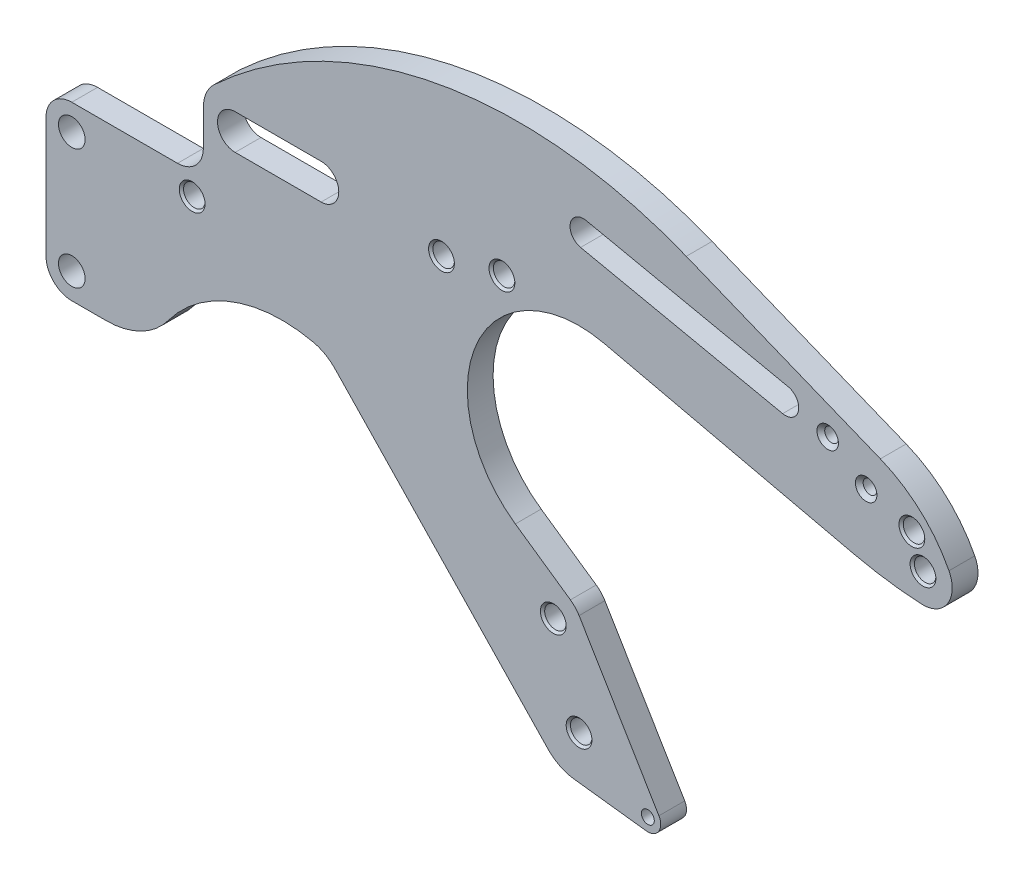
ISO-10303-21;
HEADER;
FILE_DESCRIPTION(('STEP AP214'),'2;1');
FILE_NAME('part.step','',(''),(''),'','','');
FILE_SCHEMA(('AUTOMOTIVE_DESIGN { 1 0 10303 214 1 1 1 1 }'));
ENDSEC;
DATA;
#1=APPLICATION_CONTEXT('core data for automotive mechanical design processes');
#2=APPLICATION_PROTOCOL_DEFINITION('international standard','automotive_design',2000,#1);
#3=PRODUCT_CONTEXT('',#1,'mechanical');
#4=PRODUCT('Part','Part','',(#3));
#5=PRODUCT_RELATED_PRODUCT_CATEGORY('part','',(#4));
#6=PRODUCT_DEFINITION_FORMATION('','',#4);
#7=PRODUCT_DEFINITION_CONTEXT('part definition',#1,'design');
#8=PRODUCT_DEFINITION('design','',#6,#7);
#9=PRODUCT_DEFINITION_SHAPE('','',#8);
#10=(LENGTH_UNIT() NAMED_UNIT(*) SI_UNIT(.MILLI.,.METRE.));
#11=(NAMED_UNIT(*) PLANE_ANGLE_UNIT() SI_UNIT($,.RADIAN.));
#12=(NAMED_UNIT(*) SI_UNIT($,.STERADIAN.) SOLID_ANGLE_UNIT());
#13=UNCERTAINTY_MEASURE_WITH_UNIT(LENGTH_MEASURE(1.E-05),#10,'distance_accuracy_value','');
#14=(GEOMETRIC_REPRESENTATION_CONTEXT(3) GLOBAL_UNCERTAINTY_ASSIGNED_CONTEXT((#13)) GLOBAL_UNIT_ASSIGNED_CONTEXT((#10,
#11,#12)) REPRESENTATION_CONTEXT('',''));
#15=CARTESIAN_POINT('',(0.,0.,0.));
#16=DIRECTION('',(0.,0.,1.));
#17=DIRECTION('',(1.,0.,0.));
#18=AXIS2_PLACEMENT_3D('',#15,#16,#17);
#19=CARTESIAN_POINT('',(55.,-28.,3.));
#20=DIRECTION('',(0.,0.,-1.));
#21=DIRECTION('',(-1.,0.,0.));
#22=AXIS2_PLACEMENT_3D('',#19,#20,#21);
#23=CYLINDRICAL_SURFACE('',#22,52.);
#24=CARTESIAN_POINT('',(55.,-28.,0.));
#25=DIRECTION('',(0.,0.,1.));
#26=DIRECTION('',(1.,0.,0.));
#27=AXIS2_PLACEMENT_3D('',#24,#25,#26);
#28=CIRCLE('',#27,52.);
#29=CARTESIAN_POINT('',(74.4696392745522,20.2175605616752,0.));
#30=VERTEX_POINT('',#29);
#31=CARTESIAN_POINT('',(19.575,10.0666438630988,0.));
#32=VERTEX_POINT('',#31);
#33=EDGE_CURVE('E303',#30,#32,#28,.T.);
#34=ORIENTED_EDGE('',*,*,#33,.T.);
#35=DIRECTION('',(0.,0.,-1.));
#36=VECTOR('',#35,1.);
#37=CARTESIAN_POINT('',(19.575,10.0666438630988,3.));
#38=LINE('',#37,#36);
#39=CARTESIAN_POINT('',(19.575,10.0666438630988,3.));
#40=VERTEX_POINT('',#39);
#41=EDGE_CURVE('E11',#40,#32,#38,.T.);
#42=ORIENTED_EDGE('',*,*,#41,.F.);
#43=CARTESIAN_POINT('',(55.,-28.,3.));
#44=DIRECTION('',(0.,0.,1.));
#45=DIRECTION('',(1.,0.,0.));
#46=AXIS2_PLACEMENT_3D('',#43,#44,#45);
#47=CIRCLE('',#46,52.);
#48=CARTESIAN_POINT('',(74.4696392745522,20.2175605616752,3.));
#49=VERTEX_POINT('',#48);
#50=EDGE_CURVE('E360',#49,#40,#47,.T.);
#51=ORIENTED_EDGE('',*,*,#50,.F.);
#52=DIRECTION('',(0.,0.,-1.));
#53=VECTOR('',#52,1.);
#54=CARTESIAN_POINT('',(74.4696392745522,20.2175605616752,3.));
#55=LINE('',#54,#53);
#56=EDGE_CURVE('E411',#49,#30,#55,.T.);
#57=ORIENTED_EDGE('',*,*,#56,.T.);
#58=EDGE_LOOP('',(#34,#42,#51,#57));
#59=FACE_BOUND('',#58,.T.);
#60=ADVANCED_FACE('F26',(#59),#23,.T.);
#61=CARTESIAN_POINT('',(22.3,7.1384404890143,3.));
#62=DIRECTION('',(0.,0.,-1.));
#63=DIRECTION('',(-1.,0.,0.));
#64=AXIS2_PLACEMENT_3D('',#61,#62,#63);
#65=CYLINDRICAL_SURFACE('',#64,4.);
#66=CARTESIAN_POINT('',(22.3,7.1384404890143,0.));
#67=DIRECTION('',(0.,0.,1.));
#68=DIRECTION('',(-1.,0.,0.));
#69=AXIS2_PLACEMENT_3D('',#66,#67,#68);
#70=CIRCLE('',#69,4.);
#71=CARTESIAN_POINT('',(18.3,7.13844048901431,0.));
#72=VERTEX_POINT('',#71);
#73=EDGE_CURVE('E312',#32,#72,#70,.T.);
#74=ORIENTED_EDGE('',*,*,#73,.T.);
#75=DIRECTION('',(0.,0.,-1.));
#76=VECTOR('',#75,1.);
#77=CARTESIAN_POINT('',(18.3,7.13844048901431,3.));
#78=LINE('',#77,#76);
#79=CARTESIAN_POINT('',(18.3,7.13844048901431,3.));
#80=VERTEX_POINT('',#79);
#81=EDGE_CURVE('E34',#80,#72,#78,.T.);
#82=ORIENTED_EDGE('',*,*,#81,.F.);
#83=CARTESIAN_POINT('',(22.3,7.1384404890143,3.));
#84=DIRECTION('',(0.,0.,1.));
#85=DIRECTION('',(-1.,0.,0.));
#86=AXIS2_PLACEMENT_3D('',#83,#84,#85);
#87=CIRCLE('',#86,4.);
#88=EDGE_CURVE('E363',#40,#80,#87,.T.);
#89=ORIENTED_EDGE('',*,*,#88,.F.);
#90=ORIENTED_EDGE('',*,*,#41,.T.);
#91=EDGE_LOOP('',(#74,#82,#89,#90));
#92=FACE_BOUND('',#91,.T.);
#93=ADVANCED_FACE('F507',(#92),#65,.T.);
#94=CARTESIAN_POINT('',(18.3,3.00000000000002,3.));
#95=DIRECTION('',(1.,0.,0.));
#96=DIRECTION('',(0.,1.,0.));
#97=AXIS2_PLACEMENT_3D('',#94,#95,#96);
#98=PLANE('',#97);
#99=DIRECTION('',(0.,-1.,0.));
#100=VECTOR('',#99,1.);
#101=CARTESIAN_POINT('',(18.3,3.00000000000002,0.));
#102=LINE('',#101,#100);
#103=CARTESIAN_POINT('',(18.3,3.00000000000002,0.));
#104=VERTEX_POINT('',#103);
#105=EDGE_CURVE('E314',#72,#104,#102,.T.);
#106=ORIENTED_EDGE('',*,*,#105,.T.);
#107=DIRECTION('',(0.,0.,-1.));
#108=VECTOR('',#107,1.);
#109=CARTESIAN_POINT('',(18.3,3.00000000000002,3.));
#110=LINE('',#109,#108);
#111=CARTESIAN_POINT('',(18.3,3.00000000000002,3.));
#112=VERTEX_POINT('',#111);
#113=EDGE_CURVE('E477',#112,#104,#110,.T.);
#114=ORIENTED_EDGE('',*,*,#113,.F.);
#115=DIRECTION('',(0.,-1.,0.));
#116=VECTOR('',#115,1.);
#117=CARTESIAN_POINT('',(18.3,3.00000000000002,3.));
#118=LINE('',#117,#116);
#119=EDGE_CURVE('E365',#80,#112,#118,.T.);
#120=ORIENTED_EDGE('',*,*,#119,.F.);
#121=ORIENTED_EDGE('',*,*,#81,.T.);
#122=EDGE_LOOP('',(#106,#114,#120,#121));
#123=FACE_BOUND('',#122,.T.);
#124=ADVANCED_FACE('F485',(#123),#98,.F.);
#125=CARTESIAN_POINT('',(15.3,3.,3.));
#126=DIRECTION('',(0.,0.,-1.));
#127=DIRECTION('',(-1.,0.,0.));
#128=AXIS2_PLACEMENT_3D('',#125,#126,#127);
#129=CYLINDRICAL_SURFACE('',#128,3.);
#130=CARTESIAN_POINT('',(15.3,3.,0.));
#131=DIRECTION('',(0.,0.,-1.));
#132=DIRECTION('',(1.,0.,0.));
#133=AXIS2_PLACEMENT_3D('',#130,#131,#132);
#134=CIRCLE('',#133,3.);
#135=CARTESIAN_POINT('',(15.3,0.,0.));
#136=VERTEX_POINT('',#135);
#137=EDGE_CURVE('E316',#104,#136,#134,.T.);
#138=ORIENTED_EDGE('',*,*,#137,.T.);
#139=DIRECTION('',(0.,0.,-1.));
#140=VECTOR('',#139,1.);
#141=CARTESIAN_POINT('',(15.3,0.,3.));
#142=LINE('',#141,#140);
#143=CARTESIAN_POINT('',(15.3,0.,3.));
#144=VERTEX_POINT('',#143);
#145=EDGE_CURVE('E474',#144,#136,#142,.T.);
#146=ORIENTED_EDGE('',*,*,#145,.F.);
#147=CARTESIAN_POINT('',(15.3,3.,3.));
#148=DIRECTION('',(0.,0.,-1.));
#149=DIRECTION('',(1.,0.,0.));
#150=AXIS2_PLACEMENT_3D('',#147,#148,#149);
#151=CIRCLE('',#150,3.);
#152=EDGE_CURVE('E367',#112,#144,#151,.T.);
#153=ORIENTED_EDGE('',*,*,#152,.F.);
#154=ORIENTED_EDGE('',*,*,#113,.T.);
#155=EDGE_LOOP('',(#138,#146,#153,#154));
#156=FACE_BOUND('',#155,.T.);
#157=ADVANCED_FACE('F496',(#156),#129,.F.);
#158=CARTESIAN_POINT('',(3.00000000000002,0.,3.));
#159=DIRECTION('',(0.,-1.,0.));
#160=DIRECTION('',(0.,0.,-1.));
#161=AXIS2_PLACEMENT_3D('',#158,#159,#160);
#162=PLANE('',#161);
#163=DIRECTION('',(-1.,0.,0.));
#164=VECTOR('',#163,1.);
#165=CARTESIAN_POINT('',(3.00000000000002,0.,0.));
#166=LINE('',#165,#164);
#167=CARTESIAN_POINT('',(3.00000000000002,0.,0.));
#168=VERTEX_POINT('',#167);
#169=EDGE_CURVE('E318',#136,#168,#166,.T.);
#170=ORIENTED_EDGE('',*,*,#169,.T.);
#171=DIRECTION('',(0.,0.,-1.));
#172=VECTOR('',#171,1.);
#173=CARTESIAN_POINT('',(3.00000000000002,0.,3.));
#174=LINE('',#173,#172);
#175=CARTESIAN_POINT('',(3.00000000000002,0.,3.));
#176=VERTEX_POINT('',#175);
#177=EDGE_CURVE('E471',#176,#168,#174,.T.);
#178=ORIENTED_EDGE('',*,*,#177,.F.);
#179=DIRECTION('',(-1.,0.,0.));
#180=VECTOR('',#179,1.);
#181=CARTESIAN_POINT('',(3.00000000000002,0.,3.));
#182=LINE('',#181,#180);
#183=EDGE_CURVE('E369',#144,#176,#182,.T.);
#184=ORIENTED_EDGE('',*,*,#183,.F.);
#185=ORIENTED_EDGE('',*,*,#145,.T.);
#186=EDGE_LOOP('',(#170,#178,#184,#185));
#187=FACE_BOUND('',#186,.T.);
#188=ADVANCED_FACE('F500',(#187),#162,.F.);
#189=CARTESIAN_POINT('',(3.,-3.,3.));
#190=DIRECTION('',(0.,0.,-1.));
#191=DIRECTION('',(-1.,0.,0.));
#192=AXIS2_PLACEMENT_3D('',#189,#190,#191);
#193=CYLINDRICAL_SURFACE('',#192,3.);
#194=CARTESIAN_POINT('',(3.,-3.,0.));
#195=DIRECTION('',(0.,0.,1.));
#196=DIRECTION('',(-1.,0.,0.));
#197=AXIS2_PLACEMENT_3D('',#194,#195,#196);
#198=CIRCLE('',#197,3.);
#199=CARTESIAN_POINT('',(0.,-3.00000000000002,0.));
#200=VERTEX_POINT('',#199);
#201=EDGE_CURVE('E320',#168,#200,#198,.T.);
#202=ORIENTED_EDGE('',*,*,#201,.T.);
#203=DIRECTION('',(0.,0.,-1.));
#204=VECTOR('',#203,1.);
#205=CARTESIAN_POINT('',(0.,-3.00000000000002,3.));
#206=LINE('',#205,#204);
#207=CARTESIAN_POINT('',(0.,-3.00000000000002,3.));
#208=VERTEX_POINT('',#207);
#209=EDGE_CURVE('E468',#208,#200,#206,.T.);
#210=ORIENTED_EDGE('',*,*,#209,.F.);
#211=CARTESIAN_POINT('',(3.,-3.,3.));
#212=DIRECTION('',(0.,0.,1.));
#213=DIRECTION('',(-1.,0.,0.));
#214=AXIS2_PLACEMENT_3D('',#211,#212,#213);
#215=CIRCLE('',#214,3.);
#216=EDGE_CURVE('E371',#176,#208,#215,.T.);
#217=ORIENTED_EDGE('',*,*,#216,.F.);
#218=ORIENTED_EDGE('',*,*,#177,.T.);
#219=EDGE_LOOP('',(#202,#210,#217,#218));
#220=FACE_BOUND('',#219,.T.);
#221=ADVANCED_FACE('F605',(#220),#193,.T.);
#222=CARTESIAN_POINT('',(0.,-17.,3.));
#223=DIRECTION('',(1.,0.,0.));
#224=DIRECTION('',(0.,0.,-1.));
#225=AXIS2_PLACEMENT_3D('',#222,#223,#224);
#226=PLANE('',#225);
#227=DIRECTION('',(0.,-1.,0.));
#228=VECTOR('',#227,1.);
#229=CARTESIAN_POINT('',(0.,-17.,0.));
#230=LINE('',#229,#228);
#231=CARTESIAN_POINT('',(0.,-17.,0.));
#232=VERTEX_POINT('',#231);
#233=EDGE_CURVE('E322',#200,#232,#230,.T.);
#234=ORIENTED_EDGE('',*,*,#233,.T.);
#235=DIRECTION('',(0.,0.,-1.));
#236=VECTOR('',#235,1.);
#237=CARTESIAN_POINT('',(0.,-17.,3.));
#238=LINE('',#237,#236);
#239=CARTESIAN_POINT('',(0.,-17.,3.));
#240=VERTEX_POINT('',#239);
#241=EDGE_CURVE('E465',#240,#232,#238,.T.);
#242=ORIENTED_EDGE('',*,*,#241,.F.);
#243=DIRECTION('',(0.,-1.,0.));
#244=VECTOR('',#243,1.);
#245=CARTESIAN_POINT('',(0.,-17.,3.));
#246=LINE('',#245,#244);
#247=EDGE_CURVE('E373',#208,#240,#246,.T.);
#248=ORIENTED_EDGE('',*,*,#247,.F.);
#249=ORIENTED_EDGE('',*,*,#209,.T.);
#250=EDGE_LOOP('',(#234,#242,#248,#249));
#251=FACE_BOUND('',#250,.T.);
#252=ADVANCED_FACE('F602',(#251),#226,.F.);
#253=CARTESIAN_POINT('',(3.,-17.,3.));
#254=DIRECTION('',(0.,0.,-1.));
#255=DIRECTION('',(-1.,0.,0.));
#256=AXIS2_PLACEMENT_3D('',#253,#254,#255);
#257=CYLINDRICAL_SURFACE('',#256,3.);
#258=CARTESIAN_POINT('',(3.,-17.,0.));
#259=DIRECTION('',(0.,0.,1.));
#260=DIRECTION('',(1.,0.,0.));
#261=AXIS2_PLACEMENT_3D('',#258,#259,#260);
#262=CIRCLE('',#261,3.);
#263=CARTESIAN_POINT('',(3.00000000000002,-20.,0.));
#264=VERTEX_POINT('',#263);
#265=EDGE_CURVE('E324',#232,#264,#262,.T.);
#266=ORIENTED_EDGE('',*,*,#265,.T.);
#267=DIRECTION('',(0.,0.,-1.));
#268=VECTOR('',#267,1.);
#269=CARTESIAN_POINT('',(3.00000000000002,-20.,3.));
#270=LINE('',#269,#268);
#271=CARTESIAN_POINT('',(3.00000000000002,-20.,3.));
#272=VERTEX_POINT('',#271);
#273=EDGE_CURVE('E462',#272,#264,#270,.T.);
#274=ORIENTED_EDGE('',*,*,#273,.F.);
#275=CARTESIAN_POINT('',(3.,-17.,3.));
#276=DIRECTION('',(0.,0.,1.));
#277=DIRECTION('',(1.,0.,0.));
#278=AXIS2_PLACEMENT_3D('',#275,#276,#277);
#279=CIRCLE('',#278,3.);
#280=EDGE_CURVE('E375',#240,#272,#279,.T.);
#281=ORIENTED_EDGE('',*,*,#280,.F.);
#282=ORIENTED_EDGE('',*,*,#241,.T.);
#283=EDGE_LOOP('',(#266,#274,#281,#282));
#284=FACE_BOUND('',#283,.T.);
#285=ADVANCED_FACE('F598',(#284),#257,.T.);
#286=CARTESIAN_POINT('',(3.00000000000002,-20.,3.));
#287=DIRECTION('',(0.,1.,0.));
#288=DIRECTION('',(0.,0.,1.));
#289=AXIS2_PLACEMENT_3D('',#286,#287,#288);
#290=PLANE('',#289);
#291=DIRECTION('',(1.,0.,0.));
#292=VECTOR('',#291,1.);
#293=CARTESIAN_POINT('',(3.00000000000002,-20.,0.));
#294=LINE('',#293,#292);
#295=CARTESIAN_POINT('',(6.99726090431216,-20.,0.));
#296=VERTEX_POINT('',#295);
#297=EDGE_CURVE('E326',#264,#296,#294,.T.);
#298=ORIENTED_EDGE('',*,*,#297,.T.);
#299=DIRECTION('',(0.,0.,-1.));
#300=VECTOR('',#299,1.);
#301=CARTESIAN_POINT('',(6.99726090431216,-20.,3.));
#302=LINE('',#301,#300);
#303=CARTESIAN_POINT('',(6.99726090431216,-20.,3.));
#304=VERTEX_POINT('',#303);
#305=EDGE_CURVE('E459',#304,#296,#302,.T.);
#306=ORIENTED_EDGE('',*,*,#305,.F.);
#307=DIRECTION('',(1.,0.,0.));
#308=VECTOR('',#307,1.);
#309=CARTESIAN_POINT('',(3.00000000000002,-20.,3.));
#310=LINE('',#309,#308);
#311=EDGE_CURVE('E377',#272,#304,#310,.T.);
#312=ORIENTED_EDGE('',*,*,#311,.F.);
#313=ORIENTED_EDGE('',*,*,#273,.T.);
#314=EDGE_LOOP('',(#298,#306,#312,#313));
#315=FACE_BOUND('',#314,.T.);
#316=ADVANCED_FACE('F594',(#315),#290,.F.);
#317=CARTESIAN_POINT('',(6.99726090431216,-11.,3.));
#318=DIRECTION('',(0.,0.,-1.));
#319=DIRECTION('',(-1.,0.,0.));
#320=AXIS2_PLACEMENT_3D('',#317,#318,#319);
#321=CYLINDRICAL_SURFACE('',#320,9.);
#322=CARTESIAN_POINT('',(6.99726090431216,-11.,0.));
#323=DIRECTION('',(0.,0.,1.));
#324=DIRECTION('',(-1.,0.,0.));
#325=AXIS2_PLACEMENT_3D('',#322,#323,#324);
#326=CIRCLE('',#325,9.);
#327=CARTESIAN_POINT('',(14.2194041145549,-16.3703489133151,0.));
#328=VERTEX_POINT('',#327);
#329=EDGE_CURVE('E328',#296,#328,#326,.T.);
#330=ORIENTED_EDGE('',*,*,#329,.T.);
#331=DIRECTION('',(0.,0.,-1.));
#332=VECTOR('',#331,1.);
#333=CARTESIAN_POINT('',(14.2194041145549,-16.3703489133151,3.));
#334=LINE('',#333,#332);
#335=CARTESIAN_POINT('',(14.2194041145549,-16.3703489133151,3.));
#336=VERTEX_POINT('',#335);
#337=EDGE_CURVE('E456',#336,#328,#334,.T.);
#338=ORIENTED_EDGE('',*,*,#337,.F.);
#339=CARTESIAN_POINT('',(6.99726090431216,-11.,3.));
#340=DIRECTION('',(0.,0.,1.));
#341=DIRECTION('',(-1.,0.,0.));
#342=AXIS2_PLACEMENT_3D('',#339,#340,#341);
#343=CIRCLE('',#342,9.);
#344=EDGE_CURVE('E379',#304,#336,#343,.T.);
#345=ORIENTED_EDGE('',*,*,#344,.F.);
#346=ORIENTED_EDGE('',*,*,#305,.T.);
#347=EDGE_LOOP('',(#330,#338,#345,#346));
#348=FACE_BOUND('',#347,.T.);
#349=ADVANCED_FACE('F589',(#348),#321,.T.);
#350=CARTESIAN_POINT('',(27.46,-26.215988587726,3.));
#351=DIRECTION('',(0.,0.,-1.));
#352=DIRECTION('',(-1.,0.,0.));
#353=AXIS2_PLACEMENT_3D('',#350,#351,#352);
#354=CYLINDRICAL_SURFACE('',#353,16.5);
#355=CARTESIAN_POINT('',(27.46,-26.215988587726,0.));
#356=DIRECTION('',(0.,0.,-1.));
#357=DIRECTION('',(1.,0.,0.));
#358=AXIS2_PLACEMENT_3D('',#355,#356,#357);
#359=CIRCLE('',#358,16.5);
#360=CARTESIAN_POINT('',(31.104347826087,-10.1234832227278,0.));
#361=VERTEX_POINT('',#360);
#362=EDGE_CURVE('E330',#328,#361,#359,.T.);
#363=ORIENTED_EDGE('',*,*,#362,.T.);
#364=DIRECTION('',(0.,0.,-1.));
#365=VECTOR('',#364,1.);
#366=CARTESIAN_POINT('',(31.104347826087,-10.1234832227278,3.));
#367=LINE('',#366,#365);
#368=CARTESIAN_POINT('',(31.104347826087,-10.1234832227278,3.));
#369=VERTEX_POINT('',#368);
#370=EDGE_CURVE('E453',#369,#361,#367,.T.);
#371=ORIENTED_EDGE('',*,*,#370,.F.);
#372=CARTESIAN_POINT('',(27.46,-26.215988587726,3.));
#373=DIRECTION('',(0.,0.,-1.));
#374=DIRECTION('',(1.,0.,0.));
#375=AXIS2_PLACEMENT_3D('',#372,#373,#374);
#376=CIRCLE('',#375,16.5);
#377=EDGE_CURVE('E381',#336,#369,#376,.T.);
#378=ORIENTED_EDGE('',*,*,#377,.F.);
#379=ORIENTED_EDGE('',*,*,#337,.T.);
#380=EDGE_LOOP('',(#363,#371,#378,#379));
#381=FACE_BOUND('',#380,.T.);
#382=ADVANCED_FACE('F583',(#381),#354,.F.);
#383=CARTESIAN_POINT('',(30.,-15.,3.));
#384=DIRECTION('',(0.,0.,-1.));
#385=DIRECTION('',(-1.,0.,0.));
#386=AXIS2_PLACEMENT_3D('',#383,#384,#385);
#387=CYLINDRICAL_SURFACE('',#386,4.99999999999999);
#388=CARTESIAN_POINT('',(30.,-15.,0.));
#389=DIRECTION('',(0.,0.,-1.));
#390=DIRECTION('',(1.,0.,0.));
#391=AXIS2_PLACEMENT_3D('',#388,#389,#390);
#392=CIRCLE('',#391,4.99999999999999);
#393=CARTESIAN_POINT('',(33.6140470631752,-11.5447628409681,0.));
#394=VERTEX_POINT('',#393);
#395=EDGE_CURVE('E332',#361,#394,#392,.T.);
#396=ORIENTED_EDGE('',*,*,#395,.T.);
#397=DIRECTION('',(0.,0.,-1.));
#398=VECTOR('',#397,1.);
#399=CARTESIAN_POINT('',(33.6140470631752,-11.5447628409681,3.));
#400=LINE('',#399,#398);
#401=CARTESIAN_POINT('',(33.6140470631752,-11.5447628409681,3.));
#402=VERTEX_POINT('',#401);
#403=EDGE_CURVE('E450',#402,#394,#400,.T.);
#404=ORIENTED_EDGE('',*,*,#403,.F.);
#405=CARTESIAN_POINT('',(30.,-15.,3.));
#406=DIRECTION('',(0.,0.,-1.));
#407=DIRECTION('',(1.,0.,0.));
#408=AXIS2_PLACEMENT_3D('',#405,#406,#407);
#409=CIRCLE('',#408,4.99999999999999);
#410=EDGE_CURVE('E383',#369,#402,#409,.T.);
#411=ORIENTED_EDGE('',*,*,#410,.F.);
#412=ORIENTED_EDGE('',*,*,#370,.T.);
#413=EDGE_LOOP('',(#396,#404,#411,#412));
#414=FACE_BOUND('',#413,.T.);
#415=ADVANCED_FACE('F579',(#414),#387,.F.);
#416=CARTESIAN_POINT('',(33.6140470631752,-11.5447628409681,3.));
#417=DIRECTION('',(0.722809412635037,0.691047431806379,0.));
#418=DIRECTION('',(-0.691047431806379,0.722809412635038,0.));
#419=AXIS2_PLACEMENT_3D('',#416,#417,#418);
#420=PLANE('',#419);
#421=DIRECTION('',(0.691047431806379,-0.722809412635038,0.));
#422=VECTOR('',#421,1.);
#423=CARTESIAN_POINT('',(33.6140470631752,-11.5447628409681,0.));
#424=LINE('',#423,#422);
#425=CARTESIAN_POINT('',(58.3859529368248,-37.4552371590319,0.));
#426=VERTEX_POINT('',#425);
#427=EDGE_CURVE('E334',#394,#426,#424,.T.);
#428=ORIENTED_EDGE('',*,*,#427,.T.);
#429=DIRECTION('',(0.,0.,-1.));
#430=VECTOR('',#429,1.);
#431=CARTESIAN_POINT('',(58.3859529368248,-37.4552371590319,3.));
#432=LINE('',#431,#430);
#433=CARTESIAN_POINT('',(58.3859529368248,-37.4552371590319,3.));
#434=VERTEX_POINT('',#433);
#435=EDGE_CURVE('E447',#434,#426,#432,.T.);
#436=ORIENTED_EDGE('',*,*,#435,.F.);
#437=DIRECTION('',(0.691047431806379,-0.722809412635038,0.));
#438=VECTOR('',#437,1.);
#439=CARTESIAN_POINT('',(33.6140470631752,-11.5447628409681,3.));
#440=LINE('',#439,#438);
#441=EDGE_CURVE('E385',#402,#434,#440,.T.);
#442=ORIENTED_EDGE('',*,*,#441,.F.);
#443=ORIENTED_EDGE('',*,*,#403,.T.);
#444=EDGE_LOOP('',(#428,#436,#442,#443));
#445=FACE_BOUND('',#444,.T.);
#446=ADVANCED_FACE('F574',(#445),#420,.F.);
#447=CARTESIAN_POINT('',(62.,-34.,3.));
#448=DIRECTION('',(0.,0.,-1.));
#449=DIRECTION('',(-1.,0.,0.));
#450=AXIS2_PLACEMENT_3D('',#447,#448,#449);
#451=CYLINDRICAL_SURFACE('',#450,5.00000000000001);
#452=CARTESIAN_POINT('',(62.,-34.,0.));
#453=DIRECTION('',(0.,0.,1.));
#454=DIRECTION('',(1.,0.,0.));
#455=AXIS2_PLACEMENT_3D('',#452,#453,#454);
#456=CIRCLE('',#455,5.00000000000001);
#457=CARTESIAN_POINT('',(61.3956221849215,-38.9633383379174,0.));
#458=VERTEX_POINT('',#457);
#459=EDGE_CURVE('E336',#426,#458,#456,.T.);
#460=ORIENTED_EDGE('',*,*,#459,.T.);
#461=DIRECTION('',(0.,0.,-1.));
#462=VECTOR('',#461,1.);
#463=CARTESIAN_POINT('',(61.3956221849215,-38.9633383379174,3.));
#464=LINE('',#463,#462);
#465=CARTESIAN_POINT('',(61.3956221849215,-38.9633383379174,3.));
#466=VERTEX_POINT('',#465);
#467=EDGE_CURVE('E444',#466,#458,#464,.T.);
#468=ORIENTED_EDGE('',*,*,#467,.F.);
#469=CARTESIAN_POINT('',(62.,-34.,3.));
#470=DIRECTION('',(0.,0.,1.));
#471=DIRECTION('',(1.,0.,0.));
#472=AXIS2_PLACEMENT_3D('',#469,#470,#471);
#473=CIRCLE('',#472,5.00000000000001);
#474=EDGE_CURVE('E387',#434,#466,#473,.T.);
#475=ORIENTED_EDGE('',*,*,#474,.F.);
#476=ORIENTED_EDGE('',*,*,#435,.T.);
#477=EDGE_LOOP('',(#460,#468,#475,#476));
#478=FACE_BOUND('',#477,.T.);
#479=ADVANCED_FACE('F568',(#478),#451,.T.);
#480=CARTESIAN_POINT('',(61.3956221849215,-38.9633383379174,3.));
#481=DIRECTION('',(0.120875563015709,0.992667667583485,0.));
#482=DIRECTION('',(-0.992667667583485,0.120875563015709,0.));
#483=AXIS2_PLACEMENT_3D('',#480,#481,#482);
#484=PLANE('',#483);
#485=DIRECTION('',(0.992667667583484,-0.120875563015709,0.));
#486=VECTOR('',#485,1.);
#487=CARTESIAN_POINT('',(61.3956221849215,-38.9633383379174,0.));
#488=LINE('',#487,#486);
#489=CARTESIAN_POINT('',(69.8186866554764,-39.9890015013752,0.));
#490=VERTEX_POINT('',#489);
#491=EDGE_CURVE('E338',#458,#490,#488,.T.);
#492=ORIENTED_EDGE('',*,*,#491,.T.);
#493=DIRECTION('',(0.,0.,-1.));
#494=VECTOR('',#493,1.);
#495=CARTESIAN_POINT('',(69.8186866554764,-39.9890015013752,3.));
#496=LINE('',#495,#494);
#497=CARTESIAN_POINT('',(69.8186866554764,-39.9890015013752,3.));
#498=VERTEX_POINT('',#497);
#499=EDGE_CURVE('E441',#498,#490,#496,.T.);
#500=ORIENTED_EDGE('',*,*,#499,.F.);
#501=DIRECTION('',(0.992667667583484,-0.120875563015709,0.));
#502=VECTOR('',#501,1.);
#503=CARTESIAN_POINT('',(61.3956221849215,-38.9633383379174,3.));
#504=LINE('',#503,#502);
#505=EDGE_CURVE('E389',#466,#498,#504,.T.);
#506=ORIENTED_EDGE('',*,*,#505,.F.);
#507=ORIENTED_EDGE('',*,*,#467,.T.);
#508=EDGE_LOOP('',(#492,#500,#506,#507));
#509=FACE_BOUND('',#508,.T.);
#510=ADVANCED_FACE('F564',(#509),#484,.F.);
#511=CARTESIAN_POINT('',(70.,-38.5,3.));
#512=DIRECTION('',(0.,0.,-1.));
#513=DIRECTION('',(-1.,0.,0.));
#514=AXIS2_PLACEMENT_3D('',#511,#512,#513);
#515=CYLINDRICAL_SURFACE('',#514,1.5);
#516=CARTESIAN_POINT('',(70.,-38.5,0.));
#517=DIRECTION('',(0.,0.,1.));
#518=DIRECTION('',(1.,0.,0.));
#519=AXIS2_PLACEMENT_3D('',#516,#517,#518);
#520=CIRCLE('',#519,1.5);
#521=CARTESIAN_POINT('',(71.2874223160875,-37.7302313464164,0.));
#522=VERTEX_POINT('',#521);
#523=EDGE_CURVE('E340',#490,#522,#520,.T.);
#524=ORIENTED_EDGE('',*,*,#523,.T.);
#525=DIRECTION('',(0.,0.,-1.));
#526=VECTOR('',#525,1.);
#527=CARTESIAN_POINT('',(71.2874223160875,-37.7302313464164,3.));
#528=LINE('',#527,#526);
#529=CARTESIAN_POINT('',(71.2874223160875,-37.7302313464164,3.));
#530=VERTEX_POINT('',#529);
#531=EDGE_CURVE('E438',#530,#522,#528,.T.);
#532=ORIENTED_EDGE('',*,*,#531,.F.);
#533=CARTESIAN_POINT('',(70.,-38.5,3.));
#534=DIRECTION('',(0.,0.,1.));
#535=DIRECTION('',(1.,0.,0.));
#536=AXIS2_PLACEMENT_3D('',#533,#534,#535);
#537=CIRCLE('',#536,1.5);
#538=EDGE_CURVE('E391',#498,#530,#537,.T.);
#539=ORIENTED_EDGE('',*,*,#538,.F.);
#540=ORIENTED_EDGE('',*,*,#499,.T.);
#541=EDGE_LOOP('',(#524,#532,#539,#540));
#542=FACE_BOUND('',#541,.T.);
#543=ADVANCED_FACE('F559',(#542),#515,.T.);
#544=CARTESIAN_POINT('',(62.0039854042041,-22.2038731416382,3.));
#545=DIRECTION('',(-0.858281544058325,-0.513179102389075,0.));
#546=DIRECTION('',(0.513179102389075,-0.858281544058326,0.));
#547=AXIS2_PLACEMENT_3D('',#544,#545,#546);
#548=PLANE('',#547);
#549=DIRECTION('',(-0.513179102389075,0.858281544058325,0.));
#550=VECTOR('',#549,1.);
#551=CARTESIAN_POINT('',(62.0039854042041,-22.2038731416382,0.));
#552=LINE('',#551,#550);
#553=CARTESIAN_POINT('',(62.0039854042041,-22.2038731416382,0.));
#554=VERTEX_POINT('',#553);
#555=EDGE_CURVE('E342',#522,#554,#552,.T.);
#556=ORIENTED_EDGE('',*,*,#555,.T.);
#557=DIRECTION('',(0.,0.,-1.));
#558=VECTOR('',#557,1.);
#559=CARTESIAN_POINT('',(62.0039854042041,-22.2038731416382,3.));
#560=LINE('',#559,#558);
#561=CARTESIAN_POINT('',(62.0039854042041,-22.2038731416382,3.));
#562=VERTEX_POINT('',#561);
#563=EDGE_CURVE('E435',#562,#554,#560,.T.);
#564=ORIENTED_EDGE('',*,*,#563,.F.);
#565=DIRECTION('',(-0.513179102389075,0.858281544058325,0.));
#566=VECTOR('',#565,1.);
#567=CARTESIAN_POINT('',(62.0039854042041,-22.2038731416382,3.));
#568=LINE('',#567,#566);
#569=EDGE_CURVE('E393',#530,#562,#568,.T.);
#570=ORIENTED_EDGE('',*,*,#569,.F.);
#571=ORIENTED_EDGE('',*,*,#531,.T.);
#572=EDGE_LOOP('',(#556,#564,#570,#571));
#573=FACE_BOUND('',#572,.T.);
#574=ADVANCED_FACE('F553',(#573),#548,.F.);
#575=CARTESIAN_POINT('',(59.,-24.,3.));
#576=DIRECTION('',(0.,0.,-1.));
#577=DIRECTION('',(-1.,0.,0.));
#578=AXIS2_PLACEMENT_3D('',#575,#576,#577);
#579=CYLINDRICAL_SURFACE('',#578,3.49999999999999);
#580=CARTESIAN_POINT('',(59.,-24.,0.));
#581=DIRECTION('',(0.,0.,1.));
#582=DIRECTION('',(1.,0.,0.));
#583=AXIS2_PLACEMENT_3D('',#580,#581,#582);
#584=CIRCLE('',#583,3.49999999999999);
#585=CARTESIAN_POINT('',(60.9948540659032,-21.1241423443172,0.));
#586=VERTEX_POINT('',#585);
#587=EDGE_CURVE('E344',#554,#586,#584,.T.);
#588=ORIENTED_EDGE('',*,*,#587,.T.);
#589=DIRECTION('',(0.,0.,-1.));
#590=VECTOR('',#589,1.);
#591=CARTESIAN_POINT('',(60.9948540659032,-21.1241423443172,3.));
#592=LINE('',#591,#590);
#593=CARTESIAN_POINT('',(60.9948540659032,-21.1241423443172,3.));
#594=VERTEX_POINT('',#593);
#595=EDGE_CURVE('E432',#594,#586,#592,.T.);
#596=ORIENTED_EDGE('',*,*,#595,.F.);
#597=CARTESIAN_POINT('',(59.,-24.,3.));
#598=DIRECTION('',(0.,0.,1.));
#599=DIRECTION('',(1.,0.,0.));
#600=AXIS2_PLACEMENT_3D('',#597,#598,#599);
#601=CIRCLE('',#600,3.49999999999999);
#602=EDGE_CURVE('E395',#562,#594,#601,.T.);
#603=ORIENTED_EDGE('',*,*,#602,.F.);
#604=ORIENTED_EDGE('',*,*,#563,.T.);
#605=EDGE_LOOP('',(#588,#596,#603,#604));
#606=FACE_BOUND('',#605,.T.);
#607=ADVANCED_FACE('F549',(#606),#579,.T.);
#608=CARTESIAN_POINT('',(54.5905420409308,-16.6817570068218,3.));
#609=DIRECTION('',(-0.569958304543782,-0.821673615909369,0.));
#610=DIRECTION('',(0.821673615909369,-0.569958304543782,0.));
#611=AXIS2_PLACEMENT_3D('',#608,#609,#610);
#612=PLANE('',#611);
#613=DIRECTION('',(-0.821673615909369,0.569958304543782,0.));
#614=VECTOR('',#613,1.);
#615=CARTESIAN_POINT('',(54.5905420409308,-16.6817570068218,0.));
#616=LINE('',#615,#614);
#617=CARTESIAN_POINT('',(54.5905420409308,-16.6817570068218,0.));
#618=VERTEX_POINT('',#617);
#619=EDGE_CURVE('E346',#586,#618,#616,.T.);
#620=ORIENTED_EDGE('',*,*,#619,.T.);
#621=DIRECTION('',(0.,0.,-1.));
#622=VECTOR('',#621,1.);
#623=CARTESIAN_POINT('',(54.5905420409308,-16.6817570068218,3.));
#624=LINE('',#623,#622);
#625=CARTESIAN_POINT('',(54.5905420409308,-16.6817570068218,3.));
#626=VERTEX_POINT('',#625);
#627=EDGE_CURVE('E429',#626,#618,#624,.T.);
#628=ORIENTED_EDGE('',*,*,#627,.F.);
#629=DIRECTION('',(-0.821673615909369,0.569958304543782,0.));
#630=VECTOR('',#629,1.);
#631=CARTESIAN_POINT('',(54.5905420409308,-16.6817570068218,3.));
#632=LINE('',#631,#630);
#633=EDGE_CURVE('E397',#594,#626,#632,.T.);
#634=ORIENTED_EDGE('',*,*,#633,.F.);
#635=ORIENTED_EDGE('',*,*,#595,.T.);
#636=EDGE_LOOP('',(#620,#628,#634,#635));
#637=FACE_BOUND('',#636,.T.);
#638=ADVANCED_FACE('F544',(#637),#612,.F.);
#639=CARTESIAN_POINT('',(62.,-6.,3.));
#640=DIRECTION('',(0.,0.,-1.));
#641=DIRECTION('',(-1.,0.,0.));
#642=AXIS2_PLACEMENT_3D('',#639,#640,#641);
#643=CYLINDRICAL_SURFACE('',#642,13.);
#644=CARTESIAN_POINT('',(62.,-6.,0.));
#645=DIRECTION('',(0.,0.,-1.));
#646=DIRECTION('',(1.,0.,0.));
#647=AXIS2_PLACEMENT_3D('',#644,#645,#646);
#648=CIRCLE('',#647,13.);
#649=CARTESIAN_POINT('',(64.9176123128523,6.66836762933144,0.));
#650=VERTEX_POINT('',#649);
#651=EDGE_CURVE('E348',#618,#650,#648,.T.);
#652=ORIENTED_EDGE('',*,*,#651,.T.);
#653=DIRECTION('',(0.,0.,-1.));
#654=VECTOR('',#653,1.);
#655=CARTESIAN_POINT('',(64.9176123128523,6.66836762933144,3.));
#656=LINE('',#655,#654);
#657=CARTESIAN_POINT('',(64.9176123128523,6.66836762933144,3.));
#658=VERTEX_POINT('',#657);
#659=EDGE_CURVE('E426',#658,#650,#656,.T.);
#660=ORIENTED_EDGE('',*,*,#659,.F.);
#661=CARTESIAN_POINT('',(62.,-6.,3.));
#662=DIRECTION('',(0.,0.,-1.));
#663=DIRECTION('',(1.,0.,0.));
#664=AXIS2_PLACEMENT_3D('',#661,#662,#663);
#665=CIRCLE('',#664,13.);
#666=EDGE_CURVE('E399',#626,#658,#665,.T.);
#667=ORIENTED_EDGE('',*,*,#666,.F.);
#668=ORIENTED_EDGE('',*,*,#627,.T.);
#669=EDGE_LOOP('',(#652,#660,#667,#668));
#670=FACE_BOUND('',#669,.T.);
#671=ADVANCED_FACE('F538',(#670),#643,.F.);
#672=CARTESIAN_POINT('',(64.9176123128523,6.66836762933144,3.));
#673=DIRECTION('',(0.224431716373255,0.97448981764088,0.));
#674=DIRECTION('',(-0.97448981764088,0.224431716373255,0.));
#675=AXIS2_PLACEMENT_3D('',#672,#673,#674);
#676=PLANE('',#675);
#677=DIRECTION('',(0.97448981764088,-0.224431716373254,0.));
#678=VECTOR('',#677,1.);
#679=CARTESIAN_POINT('',(64.9176123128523,6.66836762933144,0.));
#680=LINE('',#679,#678);
#681=CARTESIAN_POINT('',(93.9761410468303,-0.0240116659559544,0.));
#682=VERTEX_POINT('',#681);
#683=EDGE_CURVE('E350',#650,#682,#680,.T.);
#684=ORIENTED_EDGE('',*,*,#683,.T.);
#685=DIRECTION('',(0.,0.,-1.));
#686=VECTOR('',#685,1.);
#687=CARTESIAN_POINT('',(93.9761410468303,-0.0240116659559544,3.));
#688=LINE('',#687,#686);
#689=CARTESIAN_POINT('',(93.9761410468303,-0.0240116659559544,3.));
#690=VERTEX_POINT('',#689);
#691=EDGE_CURVE('E423',#690,#682,#688,.T.);
#692=ORIENTED_EDGE('',*,*,#691,.F.);
#693=DIRECTION('',(0.97448981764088,-0.224431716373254,0.));
#694=VECTOR('',#693,1.);
#695=CARTESIAN_POINT('',(64.9176123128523,6.66836762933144,3.));
#696=LINE('',#695,#694);
#697=EDGE_CURVE('E401',#658,#690,#696,.T.);
#698=ORIENTED_EDGE('',*,*,#697,.F.);
#699=ORIENTED_EDGE('',*,*,#659,.T.);
#700=EDGE_LOOP('',(#684,#692,#698,#699));
#701=FACE_BOUND('',#700,.T.);
#702=ADVANCED_FACE('F534',(#701),#676,.F.);
#703=CARTESIAN_POINT('',(104.3,44.8025199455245,3.));
#704=DIRECTION('',(0.,0.,-1.));
#705=DIRECTION('',(-1.,0.,0.));
#706=AXIS2_PLACEMENT_3D('',#703,#704,#705);
#707=CYLINDRICAL_SURFACE('',#706,46.);
#708=CARTESIAN_POINT('',(104.3,44.8025199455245,0.));
#709=DIRECTION('',(0.,0.,1.));
#710=DIRECTION('',(1.,0.,0.));
#711=AXIS2_PLACEMENT_3D('',#708,#709,#710);
#712=CIRCLE('',#711,46.);
#713=CARTESIAN_POINT('',(101.816431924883,-1.13038644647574,0.));
#714=VERTEX_POINT('',#713);
#715=EDGE_CURVE('E352',#682,#714,#712,.T.);
#716=ORIENTED_EDGE('',*,*,#715,.T.);
#717=DIRECTION('',(0.,0.,-1.));
#718=VECTOR('',#717,1.);
#719=CARTESIAN_POINT('',(101.816431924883,-1.13038644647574,3.));
#720=LINE('',#719,#718);
#721=CARTESIAN_POINT('',(101.816431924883,-1.13038644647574,3.));
#722=VERTEX_POINT('',#721);
#723=EDGE_CURVE('E420',#722,#714,#720,.T.);
#724=ORIENTED_EDGE('',*,*,#723,.F.);
#725=CARTESIAN_POINT('',(104.3,44.8025199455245,3.));
#726=DIRECTION('',(0.,0.,1.));
#727=DIRECTION('',(1.,0.,0.));
#728=AXIS2_PLACEMENT_3D('',#725,#726,#727);
#729=CIRCLE('',#728,46.);
#730=EDGE_CURVE('E403',#690,#722,#729,.T.);
#731=ORIENTED_EDGE('',*,*,#730,.F.);
#732=ORIENTED_EDGE('',*,*,#691,.T.);
#733=EDGE_LOOP('',(#716,#724,#731,#732));
#734=FACE_BOUND('',#733,.T.);
#735=ADVANCED_FACE('F529',(#734),#707,.T.);
#736=CARTESIAN_POINT('',(102.,2.26465446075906,3.));
#737=DIRECTION('',(0.,0.,-1.));
#738=DIRECTION('',(-1.,0.,0.));
#739=AXIS2_PLACEMENT_3D('',#736,#737,#738);
#740=CYLINDRICAL_SURFACE('',#739,3.4);
#741=CARTESIAN_POINT('',(102.,2.26465446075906,0.));
#742=DIRECTION('',(0.,0.,1.));
#743=DIRECTION('',(1.,0.,0.));
#744=AXIS2_PLACEMENT_3D('',#741,#742,#743);
#745=CIRCLE('',#744,3.4);
#746=CARTESIAN_POINT('',(105.02347107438,3.8198466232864,0.));
#747=VERTEX_POINT('',#746);
#748=EDGE_CURVE('E354',#714,#747,#745,.T.);
#749=ORIENTED_EDGE('',*,*,#748,.T.);
#750=DIRECTION('',(0.,0.,-1.));
#751=VECTOR('',#750,1.);
#752=CARTESIAN_POINT('',(105.02347107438,3.8198466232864,3.));
#753=LINE('',#752,#751);
#754=CARTESIAN_POINT('',(105.02347107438,3.8198466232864,3.));
#755=VERTEX_POINT('',#754);
#756=EDGE_CURVE('E417',#755,#747,#753,.T.);
#757=ORIENTED_EDGE('',*,*,#756,.F.);
#758=CARTESIAN_POINT('',(102.,2.26465446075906,3.));
#759=DIRECTION('',(0.,0.,1.));
#760=DIRECTION('',(1.,0.,0.));
#761=AXIS2_PLACEMENT_3D('',#758,#759,#760);
#762=CIRCLE('',#761,3.4);
#763=EDGE_CURVE('E405',#722,#755,#762,.T.);
#764=ORIENTED_EDGE('',*,*,#763,.F.);
#765=ORIENTED_EDGE('',*,*,#723,.T.);
#766=EDGE_LOOP('',(#749,#757,#764,#765));
#767=FACE_BOUND('',#766,.T.);
#768=ADVANCED_FACE('F523',(#767),#740,.T.);
#769=CARTESIAN_POINT('',(91.24,-3.27,3.));
#770=DIRECTION('',(0.,0.,-1.));
#771=DIRECTION('',(-1.,0.,0.));
#772=AXIS2_PLACEMENT_3D('',#769,#770,#771);
#773=CYLINDRICAL_SURFACE('',#772,15.5);
#774=CARTESIAN_POINT('',(91.24,-3.27,0.));
#775=DIRECTION('',(0.,0.,1.));
#776=DIRECTION('',(1.,0.,0.));
#777=AXIS2_PLACEMENT_3D('',#774,#775,#776);
#778=CIRCLE('',#777,15.5);
#779=CARTESIAN_POINT('',(97.0434501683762,11.1025420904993,0.));
#780=VERTEX_POINT('',#779);
#781=EDGE_CURVE('E356',#747,#780,#778,.T.);
#782=ORIENTED_EDGE('',*,*,#781,.T.);
#783=DIRECTION('',(0.,0.,-1.));
#784=VECTOR('',#783,1.);
#785=CARTESIAN_POINT('',(97.0434501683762,11.1025420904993,3.));
#786=LINE('',#785,#784);
#787=CARTESIAN_POINT('',(97.0434501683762,11.1025420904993,3.));
#788=VERTEX_POINT('',#787);
#789=EDGE_CURVE('E414',#788,#780,#786,.T.);
#790=ORIENTED_EDGE('',*,*,#789,.F.);
#791=CARTESIAN_POINT('',(91.24,-3.27,3.));
#792=DIRECTION('',(0.,0.,1.));
#793=DIRECTION('',(1.,0.,0.));
#794=AXIS2_PLACEMENT_3D('',#791,#792,#793);
#795=CIRCLE('',#794,15.5);
#796=EDGE_CURVE('E407',#755,#788,#795,.T.);
#797=ORIENTED_EDGE('',*,*,#796,.F.);
#798=ORIENTED_EDGE('',*,*,#756,.T.);
#799=EDGE_LOOP('',(#782,#790,#797,#798));
#800=FACE_BOUND('',#799,.T.);
#801=ADVANCED_FACE('F519',(#800),#773,.T.);
#802=CARTESIAN_POINT('',(74.4696392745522,20.2175605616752,3.));
#803=DIRECTION('',(-0.374416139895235,-0.927260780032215,0.));
#804=DIRECTION('',(0.927260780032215,-0.374416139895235,0.));
#805=AXIS2_PLACEMENT_3D('',#802,#803,#804);
#806=PLANE('',#805);
#807=DIRECTION('',(-0.927260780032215,0.374416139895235,0.));
#808=VECTOR('',#807,1.);
#809=CARTESIAN_POINT('',(74.4696392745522,20.2175605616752,0.));
#810=LINE('',#809,#808);
#811=EDGE_CURVE('E358',#780,#30,#810,.T.);
#812=ORIENTED_EDGE('',*,*,#811,.T.);
#813=ORIENTED_EDGE('',*,*,#56,.F.);
#814=DIRECTION('',(-0.927260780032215,0.374416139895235,0.));
#815=VECTOR('',#814,1.);
#816=CARTESIAN_POINT('',(74.4696392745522,20.2175605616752,3.));
#817=LINE('',#816,#815);
#818=EDGE_CURVE('E409',#788,#49,#817,.T.);
#819=ORIENTED_EDGE('',*,*,#818,.F.);
#820=ORIENTED_EDGE('',*,*,#789,.T.);
#821=EDGE_LOOP('',(#812,#813,#819,#820));
#822=FACE_BOUND('',#821,.T.);
#823=ADVANCED_FACE('F514',(#822),#806,.F.);
#824=CARTESIAN_POINT('',(55.,-28.,3.));
#825=DIRECTION('',(0.,0.,1.));
#826=DIRECTION('',(1.,0.,0.));
#827=AXIS2_PLACEMENT_3D('',#824,#825,#826);
#828=PLANE('',#827);
#829=CARTESIAN_POINT('',(70.,-38.5,3.));
#830=DIRECTION('',(0.,0.,1.));
#831=DIRECTION('',(1.,0.,0.));
#832=AXIS2_PLACEMENT_3D('',#829,#830,#831);
#833=CIRCLE('',#832,0.749999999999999);
#834=CARTESIAN_POINT('',(70.75,-38.5,3.));
#835=VERTEX_POINT('',#834);
#836=EDGE_CURVE('E1064',#835,#835,#833,.T.);
#837=ORIENTED_EDGE('',*,*,#836,.F.);
#838=EDGE_LOOP('',(#837));
#839=FACE_BOUND('',#838,.T.);
#840=CARTESIAN_POINT('',(90.92,10.24,3.));
#841=DIRECTION('',(0.,0.,1.));
#842=DIRECTION('',(1.,0.,0.));
#843=AXIS2_PLACEMENT_3D('',#840,#841,#842);
#844=CIRCLE('',#843,1.25);
#845=CARTESIAN_POINT('',(92.17,10.24,3.));
#846=VERTEX_POINT('',#845);
#847=EDGE_CURVE('E1078',#846,#846,#844,.T.);
#848=ORIENTED_EDGE('',*,*,#847,.F.);
#849=EDGE_LOOP('',(#848));
#850=FACE_BOUND('',#849,.T.);
#851=CARTESIAN_POINT('',(95.39,7.24,3.));
#852=DIRECTION('',(0.,0.,1.));
#853=DIRECTION('',(1.,0.,0.));
#854=AXIS2_PLACEMENT_3D('',#851,#852,#853);
#855=CIRCLE('',#854,1.25);
#856=CARTESIAN_POINT('',(96.64,7.24,3.));
#857=VERTEX_POINT('',#856);
#858=EDGE_CURVE('E1090',#857,#857,#855,.T.);
#859=ORIENTED_EDGE('',*,*,#858,.F.);
#860=EDGE_LOOP('',(#859));
#861=FACE_BOUND('',#860,.T.);
#862=CARTESIAN_POINT('',(62.,-34.,3.));
#863=DIRECTION('',(0.,0.,1.));
#864=DIRECTION('',(1.,0.,0.));
#865=AXIS2_PLACEMENT_3D('',#862,#863,#864);
#866=CIRCLE('',#865,1.5);
#867=CARTESIAN_POINT('',(63.5,-34.,3.));
#868=VERTEX_POINT('',#867);
#869=EDGE_CURVE('E1093',#868,#868,#866,.T.);
#870=ORIENTED_EDGE('',*,*,#869,.F.);
#871=EDGE_LOOP('',(#870));
#872=FACE_BOUND('',#871,.T.);
#873=CARTESIAN_POINT('',(53.03,7.56,3.));
#874=DIRECTION('',(0.,0.,1.));
#875=DIRECTION('',(1.,0.,0.));
#876=AXIS2_PLACEMENT_3D('',#873,#874,#875);
#877=CIRCLE('',#876,1.5);
#878=CARTESIAN_POINT('',(54.53,7.56,3.));
#879=VERTEX_POINT('',#878);
#880=EDGE_CURVE('E1105',#879,#879,#877,.T.);
#881=ORIENTED_EDGE('',*,*,#880,.F.);
#882=EDGE_LOOP('',(#881));
#883=FACE_BOUND('',#882,.T.);
#884=CARTESIAN_POINT('',(59.,-24.,3.));
#885=DIRECTION('',(0.,0.,1.));
#886=DIRECTION('',(1.,0.,0.));
#887=AXIS2_PLACEMENT_3D('',#884,#885,#886);
#888=CIRCLE('',#887,1.5);
#889=CARTESIAN_POINT('',(60.5,-24.,3.));
#890=VERTEX_POINT('',#889);
#891=EDGE_CURVE('E1117',#890,#890,#888,.T.);
#892=ORIENTED_EDGE('',*,*,#891,.F.);
#893=EDGE_LOOP('',(#892));
#894=FACE_BOUND('',#893,.T.);
#895=CARTESIAN_POINT('',(46.,6.,3.));
#896=DIRECTION('',(0.,0.,1.));
#897=DIRECTION('',(1.,0.,0.));
#898=AXIS2_PLACEMENT_3D('',#895,#896,#897);
#899=CIRCLE('',#898,1.5);
#900=CARTESIAN_POINT('',(47.5,6.,3.));
#901=VERTEX_POINT('',#900);
#902=EDGE_CURVE('E1129',#901,#901,#899,.T.);
#903=ORIENTED_EDGE('',*,*,#902,.F.);
#904=EDGE_LOOP('',(#903));
#905=FACE_BOUND('',#904,.T.);
#906=CARTESIAN_POINT('',(100.71,5.6,3.));
#907=DIRECTION('',(0.,0.,1.));
#908=DIRECTION('',(1.,0.,0.));
#909=AXIS2_PLACEMENT_3D('',#906,#907,#908);
#910=CIRCLE('',#909,1.5);
#911=CARTESIAN_POINT('',(102.21,5.6,3.));
#912=VERTEX_POINT('',#911);
#913=EDGE_CURVE('E1141',#912,#912,#910,.T.);
#914=ORIENTED_EDGE('',*,*,#913,.F.);
#915=EDGE_LOOP('',(#914));
#916=FACE_BOUND('',#915,.T.);
#917=CARTESIAN_POINT('',(102.,2.26,3.));
#918=DIRECTION('',(0.,0.,1.));
#919=DIRECTION('',(1.,0.,0.));
#920=AXIS2_PLACEMENT_3D('',#917,#918,#919);
#921=CIRCLE('',#920,1.5);
#922=CARTESIAN_POINT('',(103.5,2.26,3.));
#923=VERTEX_POINT('',#922);
#924=EDGE_CURVE('E1153',#923,#923,#921,.T.);
#925=ORIENTED_EDGE('',*,*,#924,.F.);
#926=EDGE_LOOP('',(#925));
#927=FACE_BOUND('',#926,.T.);
#928=CARTESIAN_POINT('',(17.,-2.5,3.));
#929=DIRECTION('',(0.,0.,1.));
#930=DIRECTION('',(1.,0.,0.));
#931=AXIS2_PLACEMENT_3D('',#928,#929,#930);
#932=CIRCLE('',#931,1.5);
#933=CARTESIAN_POINT('',(18.5,-2.5,3.));
#934=VERTEX_POINT('',#933);
#935=EDGE_CURVE('E1165',#934,#934,#932,.T.);
#936=ORIENTED_EDGE('',*,*,#935,.F.);
#937=EDGE_LOOP('',(#936));
#938=FACE_BOUND('',#937,.T.);
#939=CARTESIAN_POINT('',(3.,-17.,3.));
#940=DIRECTION('',(0.,0.,1.));
#941=DIRECTION('',(1.,0.,0.));
#942=AXIS2_PLACEMENT_3D('',#939,#940,#941);
#943=CIRCLE('',#942,1.55);
#944=CARTESIAN_POINT('',(4.55,-17.,3.));
#945=VERTEX_POINT('',#944);
#946=EDGE_CURVE('E1177',#945,#945,#943,.T.);
#947=ORIENTED_EDGE('',*,*,#946,.F.);
#948=EDGE_LOOP('',(#947));
#949=FACE_BOUND('',#948,.T.);
#950=CARTESIAN_POINT('',(3.,-3.,3.));
#951=DIRECTION('',(0.,0.,1.));
#952=DIRECTION('',(1.,0.,0.));
#953=AXIS2_PLACEMENT_3D('',#950,#951,#952);
#954=CIRCLE('',#953,1.55);
#955=CARTESIAN_POINT('',(4.55,-3.,3.));
#956=VERTEX_POINT('',#955);
#957=EDGE_CURVE('E1183',#956,#956,#954,.T.);
#958=ORIENTED_EDGE('',*,*,#957,.F.);
#959=EDGE_LOOP('',(#958));
#960=FACE_BOUND('',#959,.T.);
#961=CARTESIAN_POINT('',(62.5,16.48,3.));
#962=DIRECTION('',(0.,0.,1.));
#963=DIRECTION('',(1.,0.,0.));
#964=AXIS2_PLACEMENT_3D('',#961,#962,#963);
#965=CIRCLE('',#964,1.55);
#966=CARTESIAN_POINT('',(62.8219495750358,17.996195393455,3.));
#967=VERTEX_POINT('',#966);
#968=CARTESIAN_POINT('',(62.1780504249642,14.963804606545,3.));
#969=VERTEX_POINT('',#968);
#970=EDGE_CURVE('E41',#967,#969,#965,.T.);
#971=ORIENTED_EDGE('',*,*,#970,.F.);
#972=DIRECTION('',(-0.978190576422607,0.207709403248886,0.));
#973=VECTOR('',#972,1.);
#974=CARTESIAN_POINT('',(62.8219495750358,17.996195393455,3.));
#975=LINE('',#974,#973);
#976=CARTESIAN_POINT('',(86.3219495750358,13.006195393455,3.));
#977=VERTEX_POINT('',#976);
#978=EDGE_CURVE('E259',#977,#967,#975,.T.);
#979=ORIENTED_EDGE('',*,*,#978,.F.);
#980=CARTESIAN_POINT('',(86.,11.49,3.));
#981=DIRECTION('',(0.,0.,1.));
#982=DIRECTION('',(1.,0.,0.));
#983=AXIS2_PLACEMENT_3D('',#980,#981,#982);
#984=CIRCLE('',#983,1.55);
#985=CARTESIAN_POINT('',(85.6780504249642,9.97380460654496,3.));
#986=VERTEX_POINT('',#985);
#987=EDGE_CURVE('E243',#986,#977,#984,.T.);
#988=ORIENTED_EDGE('',*,*,#987,.F.);
#989=DIRECTION('',(0.978190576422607,-0.207709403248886,0.));
#990=VECTOR('',#989,1.);
#991=CARTESIAN_POINT('',(62.1780504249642,14.963804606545,3.));
#992=LINE('',#991,#990);
#993=EDGE_CURVE('E252',#969,#986,#992,.T.);
#994=ORIENTED_EDGE('',*,*,#993,.F.);
#995=EDGE_LOOP('',(#971,#979,#988,#994));
#996=FACE_BOUND('',#995,.T.);
#997=CARTESIAN_POINT('',(32.,6.5,3.));
#998=DIRECTION('',(0.,0.,1.));
#999=DIRECTION('',(1.,0.,0.));
#1000=AXIS2_PLACEMENT_3D('',#997,#998,#999);
#1001=CIRCLE('',#1000,2.05);
#1002=CARTESIAN_POINT('',(32.,4.45,3.));
#1003=VERTEX_POINT('',#1002);
#1004=CARTESIAN_POINT('',(32.,8.55,3.));
#1005=VERTEX_POINT('',#1004);
#1006=EDGE_CURVE('E275',#1003,#1005,#1001,.T.);
#1007=ORIENTED_EDGE('',*,*,#1006,.F.);
#1008=DIRECTION('',(1.,0.,0.));
#1009=VECTOR('',#1008,1.);
#1010=CARTESIAN_POINT('',(22.,4.45,3.));
#1011=LINE('',#1010,#1009);
#1012=CARTESIAN_POINT('',(22.,4.45,3.));
#1013=VERTEX_POINT('',#1012);
#1014=EDGE_CURVE('E285',#1013,#1003,#1011,.T.);
#1015=ORIENTED_EDGE('',*,*,#1014,.F.);
#1016=CARTESIAN_POINT('',(22.,6.5,3.));
#1017=DIRECTION('',(0.,0.,1.));
#1018=DIRECTION('',(1.,0.,0.));
#1019=AXIS2_PLACEMENT_3D('',#1016,#1017,#1018);
#1020=CIRCLE('',#1019,2.05);
#1021=CARTESIAN_POINT('',(22.,8.55,3.));
#1022=VERTEX_POINT('',#1021);
#1023=EDGE_CURVE('E282',#1022,#1013,#1020,.T.);
#1024=ORIENTED_EDGE('',*,*,#1023,.F.);
#1025=DIRECTION('',(-1.,0.,0.));
#1026=VECTOR('',#1025,1.);
#1027=CARTESIAN_POINT('',(22.,8.55,3.));
#1028=LINE('',#1027,#1026);
#1029=EDGE_CURVE('E279',#1005,#1022,#1028,.T.);
#1030=ORIENTED_EDGE('',*,*,#1029,.F.);
#1031=EDGE_LOOP('',(#1007,#1015,#1024,#1030));
#1032=FACE_BOUND('',#1031,.T.);
#1033=ORIENTED_EDGE('',*,*,#50,.T.);
#1034=ORIENTED_EDGE('',*,*,#88,.T.);
#1035=ORIENTED_EDGE('',*,*,#119,.T.);
#1036=ORIENTED_EDGE('',*,*,#152,.T.);
#1037=ORIENTED_EDGE('',*,*,#183,.T.);
#1038=ORIENTED_EDGE('',*,*,#216,.T.);
#1039=ORIENTED_EDGE('',*,*,#247,.T.);
#1040=ORIENTED_EDGE('',*,*,#280,.T.);
#1041=ORIENTED_EDGE('',*,*,#311,.T.);
#1042=ORIENTED_EDGE('',*,*,#344,.T.);
#1043=ORIENTED_EDGE('',*,*,#377,.T.);
#1044=ORIENTED_EDGE('',*,*,#410,.T.);
#1045=ORIENTED_EDGE('',*,*,#441,.T.);
#1046=ORIENTED_EDGE('',*,*,#474,.T.);
#1047=ORIENTED_EDGE('',*,*,#505,.T.);
#1048=ORIENTED_EDGE('',*,*,#538,.T.);
#1049=ORIENTED_EDGE('',*,*,#569,.T.);
#1050=ORIENTED_EDGE('',*,*,#602,.T.);
#1051=ORIENTED_EDGE('',*,*,#633,.T.);
#1052=ORIENTED_EDGE('',*,*,#666,.T.);
#1053=ORIENTED_EDGE('',*,*,#697,.T.);
#1054=ORIENTED_EDGE('',*,*,#730,.T.);
#1055=ORIENTED_EDGE('',*,*,#763,.T.);
#1056=ORIENTED_EDGE('',*,*,#796,.T.);
#1057=ORIENTED_EDGE('',*,*,#818,.T.);
#1058=EDGE_LOOP('',(#1033,#1034,#1035,#1036,#1037,#1038,#1039,#1040,#1041,#1042,#1043,#1044,
#1045,#1046,#1047,#1048,#1049,#1050,#1051,#1052,#1053,#1054,#1055,#1056,#1057));
#1059=FACE_BOUND('',#1058,.T.);
#1060=ADVANCED_FACE('F256',(#839,#850,#861,#872,#883,#894,#905,#916,#927,#938,#949,#960,#996,
#1032,#1059),#828,.T.);
#1061=CARTESIAN_POINT('',(55.,-28.,0.));
#1062=DIRECTION('',(0.,0.,1.));
#1063=DIRECTION('',(1.,0.,0.));
#1064=AXIS2_PLACEMENT_3D('',#1061,#1062,#1063);
#1065=PLANE('',#1064);
#1066=CARTESIAN_POINT('',(70.,-38.5,0.));
#1067=DIRECTION('',(0.,0.,1.));
#1068=DIRECTION('',(1.,0.,0.));
#1069=AXIS2_PLACEMENT_3D('',#1066,#1067,#1068);
#1070=CIRCLE('',#1069,0.749999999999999);
#1071=CARTESIAN_POINT('',(70.75,-38.5,0.));
#1072=VERTEX_POINT('',#1071);
#1073=EDGE_CURVE('E29',#1072,#1072,#1070,.T.);
#1074=ORIENTED_EDGE('',*,*,#1073,.T.);
#1075=EDGE_LOOP('',(#1074));
#1076=FACE_BOUND('',#1075,.T.);
#1077=CARTESIAN_POINT('',(90.92,10.24,0.));
#1078=DIRECTION('',(0.,0.,1.));
#1079=DIRECTION('',(1.,0.,0.));
#1080=AXIS2_PLACEMENT_3D('',#1077,#1078,#1079);
#1081=CIRCLE('',#1080,1.25);
#1082=CARTESIAN_POINT('',(92.17,10.24,0.));
#1083=VERTEX_POINT('',#1082);
#1084=EDGE_CURVE('E1067',#1083,#1083,#1081,.T.);
#1085=ORIENTED_EDGE('',*,*,#1084,.T.);
#1086=EDGE_LOOP('',(#1085));
#1087=FACE_BOUND('',#1086,.T.);
#1088=CARTESIAN_POINT('',(95.39,7.24,0.));
#1089=DIRECTION('',(0.,0.,1.));
#1090=DIRECTION('',(1.,0.,0.));
#1091=AXIS2_PLACEMENT_3D('',#1088,#1089,#1090);
#1092=CIRCLE('',#1091,1.25);
#1093=CARTESIAN_POINT('',(96.64,7.24,0.));
#1094=VERTEX_POINT('',#1093);
#1095=EDGE_CURVE('E1081',#1094,#1094,#1092,.T.);
#1096=ORIENTED_EDGE('',*,*,#1095,.T.);
#1097=EDGE_LOOP('',(#1096));
#1098=FACE_BOUND('',#1097,.T.);
#1099=CARTESIAN_POINT('',(62.,-34.,0.));
#1100=DIRECTION('',(0.,0.,1.));
#1101=DIRECTION('',(1.,0.,0.));
#1102=AXIS2_PLACEMENT_3D('',#1099,#1100,#1101);
#1103=CIRCLE('',#1102,1.5);
#1104=CARTESIAN_POINT('',(63.5,-34.,0.));
#1105=VERTEX_POINT('',#1104);
#1106=EDGE_CURVE('E1102',#1105,#1105,#1103,.T.);
#1107=ORIENTED_EDGE('',*,*,#1106,.T.);
#1108=EDGE_LOOP('',(#1107));
#1109=FACE_BOUND('',#1108,.T.);
#1110=CARTESIAN_POINT('',(53.03,7.56,0.));
#1111=DIRECTION('',(0.,0.,1.));
#1112=DIRECTION('',(1.,0.,0.));
#1113=AXIS2_PLACEMENT_3D('',#1110,#1111,#1112);
#1114=CIRCLE('',#1113,1.5);
#1115=CARTESIAN_POINT('',(54.53,7.56,0.));
#1116=VERTEX_POINT('',#1115);
#1117=EDGE_CURVE('E1114',#1116,#1116,#1114,.T.);
#1118=ORIENTED_EDGE('',*,*,#1117,.T.);
#1119=EDGE_LOOP('',(#1118));
#1120=FACE_BOUND('',#1119,.T.);
#1121=CARTESIAN_POINT('',(59.,-24.,0.));
#1122=DIRECTION('',(0.,0.,1.));
#1123=DIRECTION('',(1.,0.,0.));
#1124=AXIS2_PLACEMENT_3D('',#1121,#1122,#1123);
#1125=CIRCLE('',#1124,1.5);
#1126=CARTESIAN_POINT('',(60.5,-24.,0.));
#1127=VERTEX_POINT('',#1126);
#1128=EDGE_CURVE('E1126',#1127,#1127,#1125,.T.);
#1129=ORIENTED_EDGE('',*,*,#1128,.T.);
#1130=EDGE_LOOP('',(#1129));
#1131=FACE_BOUND('',#1130,.T.);
#1132=CARTESIAN_POINT('',(46.,6.,0.));
#1133=DIRECTION('',(0.,0.,1.));
#1134=DIRECTION('',(1.,0.,0.));
#1135=AXIS2_PLACEMENT_3D('',#1132,#1133,#1134);
#1136=CIRCLE('',#1135,1.5);
#1137=CARTESIAN_POINT('',(47.5,6.,0.));
#1138=VERTEX_POINT('',#1137);
#1139=EDGE_CURVE('E1138',#1138,#1138,#1136,.T.);
#1140=ORIENTED_EDGE('',*,*,#1139,.T.);
#1141=EDGE_LOOP('',(#1140));
#1142=FACE_BOUND('',#1141,.T.);
#1143=CARTESIAN_POINT('',(100.71,5.6,0.));
#1144=DIRECTION('',(0.,0.,1.));
#1145=DIRECTION('',(1.,0.,0.));
#1146=AXIS2_PLACEMENT_3D('',#1143,#1144,#1145);
#1147=CIRCLE('',#1146,1.5);
#1148=CARTESIAN_POINT('',(102.21,5.6,0.));
#1149=VERTEX_POINT('',#1148);
#1150=EDGE_CURVE('E1150',#1149,#1149,#1147,.T.);
#1151=ORIENTED_EDGE('',*,*,#1150,.T.);
#1152=EDGE_LOOP('',(#1151));
#1153=FACE_BOUND('',#1152,.T.);
#1154=CARTESIAN_POINT('',(102.,2.26,0.));
#1155=DIRECTION('',(0.,0.,1.));
#1156=DIRECTION('',(1.,0.,0.));
#1157=AXIS2_PLACEMENT_3D('',#1154,#1155,#1156);
#1158=CIRCLE('',#1157,1.5);
#1159=CARTESIAN_POINT('',(103.5,2.26,0.));
#1160=VERTEX_POINT('',#1159);
#1161=EDGE_CURVE('E1162',#1160,#1160,#1158,.T.);
#1162=ORIENTED_EDGE('',*,*,#1161,.T.);
#1163=EDGE_LOOP('',(#1162));
#1164=FACE_BOUND('',#1163,.T.);
#1165=CARTESIAN_POINT('',(17.,-2.5,0.));
#1166=DIRECTION('',(0.,0.,1.));
#1167=DIRECTION('',(1.,0.,0.));
#1168=AXIS2_PLACEMENT_3D('',#1165,#1166,#1167);
#1169=CIRCLE('',#1168,1.5);
#1170=CARTESIAN_POINT('',(18.5,-2.5,0.));
#1171=VERTEX_POINT('',#1170);
#1172=EDGE_CURVE('E1174',#1171,#1171,#1169,.T.);
#1173=ORIENTED_EDGE('',*,*,#1172,.T.);
#1174=EDGE_LOOP('',(#1173));
#1175=FACE_BOUND('',#1174,.T.);
#1176=CARTESIAN_POINT('',(3.,-17.,0.));
#1177=DIRECTION('',(0.,0.,1.));
#1178=DIRECTION('',(1.,0.,0.));
#1179=AXIS2_PLACEMENT_3D('',#1176,#1177,#1178);
#1180=CIRCLE('',#1179,1.55);
#1181=CARTESIAN_POINT('',(4.55,-17.,0.));
#1182=VERTEX_POINT('',#1181);
#1183=EDGE_CURVE('E1180',#1182,#1182,#1180,.T.);
#1184=ORIENTED_EDGE('',*,*,#1183,.T.);
#1185=EDGE_LOOP('',(#1184));
#1186=FACE_BOUND('',#1185,.T.);
#1187=CARTESIAN_POINT('',(3.,-3.,0.));
#1188=DIRECTION('',(0.,0.,1.));
#1189=DIRECTION('',(1.,0.,0.));
#1190=AXIS2_PLACEMENT_3D('',#1187,#1188,#1189);
#1191=CIRCLE('',#1190,1.55);
#1192=CARTESIAN_POINT('',(4.55,-3.,0.));
#1193=VERTEX_POINT('',#1192);
#1194=EDGE_CURVE('E1186',#1193,#1193,#1191,.T.);
#1195=ORIENTED_EDGE('',*,*,#1194,.T.);
#1196=EDGE_LOOP('',(#1195));
#1197=FACE_BOUND('',#1196,.T.);
#1198=DIRECTION('',(-0.978190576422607,0.207709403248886,0.));
#1199=VECTOR('',#1198,1.);
#1200=CARTESIAN_POINT('',(62.8219495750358,17.996195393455,0.));
#1201=LINE('',#1200,#1199);
#1202=CARTESIAN_POINT('',(86.3219495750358,13.006195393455,0.));
#1203=VERTEX_POINT('',#1202);
#1204=CARTESIAN_POINT('',(62.8219495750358,17.996195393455,0.));
#1205=VERTEX_POINT('',#1204);
#1206=EDGE_CURVE('E270',#1203,#1205,#1201,.T.);
#1207=ORIENTED_EDGE('',*,*,#1206,.T.);
#1208=CARTESIAN_POINT('',(62.5,16.48,0.));
#1209=DIRECTION('',(0.,0.,1.));
#1210=DIRECTION('',(1.,0.,0.));
#1211=AXIS2_PLACEMENT_3D('',#1208,#1209,#1210);
#1212=CIRCLE('',#1211,1.55);
#1213=CARTESIAN_POINT('',(62.1780504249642,14.963804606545,0.));
#1214=VERTEX_POINT('',#1213);
#1215=EDGE_CURVE('E261',#1205,#1214,#1212,.T.);
#1216=ORIENTED_EDGE('',*,*,#1215,.T.);
#1217=DIRECTION('',(0.978190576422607,-0.207709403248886,0.));
#1218=VECTOR('',#1217,1.);
#1219=CARTESIAN_POINT('',(62.1780504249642,14.963804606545,0.));
#1220=LINE('',#1219,#1218);
#1221=CARTESIAN_POINT('',(85.6780504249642,9.97380460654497,0.));
#1222=VERTEX_POINT('',#1221);
#1223=EDGE_CURVE('E267',#1214,#1222,#1220,.T.);
#1224=ORIENTED_EDGE('',*,*,#1223,.T.);
#1225=CARTESIAN_POINT('',(86.,11.49,0.));
#1226=DIRECTION('',(0.,0.,1.));
#1227=DIRECTION('',(1.,0.,0.));
#1228=AXIS2_PLACEMENT_3D('',#1225,#1226,#1227);
#1229=CIRCLE('',#1228,1.55);
#1230=EDGE_CURVE('E49',#1222,#1203,#1229,.T.);
#1231=ORIENTED_EDGE('',*,*,#1230,.T.);
#1232=EDGE_LOOP('',(#1207,#1216,#1224,#1231));
#1233=FACE_BOUND('',#1232,.T.);
#1234=DIRECTION('',(1.,0.,0.));
#1235=VECTOR('',#1234,1.);
#1236=CARTESIAN_POINT('',(22.,4.45,0.));
#1237=LINE('',#1236,#1235);
#1238=CARTESIAN_POINT('',(22.,4.45,0.));
#1239=VERTEX_POINT('',#1238);
#1240=CARTESIAN_POINT('',(32.,4.45,0.));
#1241=VERTEX_POINT('',#1240);
#1242=EDGE_CURVE('E297',#1239,#1241,#1237,.T.);
#1243=ORIENTED_EDGE('',*,*,#1242,.T.);
#1244=CARTESIAN_POINT('',(32.,6.5,0.));
#1245=DIRECTION('',(0.,0.,1.));
#1246=DIRECTION('',(1.,0.,0.));
#1247=AXIS2_PLACEMENT_3D('',#1244,#1245,#1246);
#1248=CIRCLE('',#1247,2.05);
#1249=CARTESIAN_POINT('',(32.,8.55,0.));
#1250=VERTEX_POINT('',#1249);
#1251=EDGE_CURVE('E288',#1241,#1250,#1248,.T.);
#1252=ORIENTED_EDGE('',*,*,#1251,.T.);
#1253=DIRECTION('',(-1.,0.,0.));
#1254=VECTOR('',#1253,1.);
#1255=CARTESIAN_POINT('',(22.,8.55,0.));
#1256=LINE('',#1255,#1254);
#1257=CARTESIAN_POINT('',(22.,8.55,0.));
#1258=VERTEX_POINT('',#1257);
#1259=EDGE_CURVE('E291',#1250,#1258,#1256,.T.);
#1260=ORIENTED_EDGE('',*,*,#1259,.T.);
#1261=CARTESIAN_POINT('',(22.,6.5,0.));
#1262=DIRECTION('',(0.,0.,1.));
#1263=DIRECTION('',(1.,0.,0.));
#1264=AXIS2_PLACEMENT_3D('',#1261,#1262,#1263);
#1265=CIRCLE('',#1264,2.05);
#1266=EDGE_CURVE('E294',#1258,#1239,#1265,.T.);
#1267=ORIENTED_EDGE('',*,*,#1266,.T.);
#1268=EDGE_LOOP('',(#1243,#1252,#1260,#1267));
#1269=FACE_BOUND('',#1268,.T.);
#1270=ORIENTED_EDGE('',*,*,#33,.F.);
#1271=ORIENTED_EDGE('',*,*,#811,.F.);
#1272=ORIENTED_EDGE('',*,*,#781,.F.);
#1273=ORIENTED_EDGE('',*,*,#748,.F.);
#1274=ORIENTED_EDGE('',*,*,#715,.F.);
#1275=ORIENTED_EDGE('',*,*,#683,.F.);
#1276=ORIENTED_EDGE('',*,*,#651,.F.);
#1277=ORIENTED_EDGE('',*,*,#619,.F.);
#1278=ORIENTED_EDGE('',*,*,#587,.F.);
#1279=ORIENTED_EDGE('',*,*,#555,.F.);
#1280=ORIENTED_EDGE('',*,*,#523,.F.);
#1281=ORIENTED_EDGE('',*,*,#491,.F.);
#1282=ORIENTED_EDGE('',*,*,#459,.F.);
#1283=ORIENTED_EDGE('',*,*,#427,.F.);
#1284=ORIENTED_EDGE('',*,*,#395,.F.);
#1285=ORIENTED_EDGE('',*,*,#362,.F.);
#1286=ORIENTED_EDGE('',*,*,#329,.F.);
#1287=ORIENTED_EDGE('',*,*,#297,.F.);
#1288=ORIENTED_EDGE('',*,*,#265,.F.);
#1289=ORIENTED_EDGE('',*,*,#233,.F.);
#1290=ORIENTED_EDGE('',*,*,#201,.F.);
#1291=ORIENTED_EDGE('',*,*,#169,.F.);
#1292=ORIENTED_EDGE('',*,*,#137,.F.);
#1293=ORIENTED_EDGE('',*,*,#105,.F.);
#1294=ORIENTED_EDGE('',*,*,#73,.F.);
#1295=EDGE_LOOP('',(#1270,#1271,#1272,#1273,#1274,#1275,#1276,#1277,#1278,#1279,#1280,#1281,
#1282,#1283,#1284,#1285,#1286,#1287,#1288,#1289,#1290,#1291,#1292,#1293,#1294));
#1296=FACE_BOUND('',#1295,.T.);
#1297=ADVANCED_FACE('F491',(#1076,#1087,#1098,#1109,#1120,#1131,#1142,#1153,#1164,#1175,#1186,
#1197,#1233,#1269,#1296),#1065,.F.);
#1298=CARTESIAN_POINT('',(32.,6.5,0.));
#1299=DIRECTION('',(0.,0.,1.));
#1300=DIRECTION('',(1.,0.,0.));
#1301=AXIS2_PLACEMENT_3D('',#1298,#1299,#1300);
#1302=CYLINDRICAL_SURFACE('',#1301,2.05);
#1303=ORIENTED_EDGE('',*,*,#1006,.T.);
#1304=DIRECTION('',(0.,0.,1.));
#1305=VECTOR('',#1304,1.);
#1306=CARTESIAN_POINT('',(32.,8.55,0.));
#1307=LINE('',#1306,#1305);
#1308=EDGE_CURVE('E300',#1250,#1005,#1307,.T.);
#1309=ORIENTED_EDGE('',*,*,#1308,.F.);
#1310=ORIENTED_EDGE('',*,*,#1251,.F.);
#1311=DIRECTION('',(0.,0.,1.));
#1312=VECTOR('',#1311,1.);
#1313=CARTESIAN_POINT('',(32.,4.45,0.));
#1314=LINE('',#1313,#1312);
#1315=EDGE_CURVE('E301',#1241,#1003,#1314,.T.);
#1316=ORIENTED_EDGE('',*,*,#1315,.T.);
#1317=EDGE_LOOP('',(#1303,#1309,#1310,#1316));
#1318=FACE_BOUND('',#1317,.T.);
#1319=ADVANCED_FACE('F762',(#1318),#1302,.F.);
#1320=CARTESIAN_POINT('',(22.,4.45,0.));
#1321=DIRECTION('',(0.,-1.,0.));
#1322=DIRECTION('',(0.,0.,-1.));
#1323=AXIS2_PLACEMENT_3D('',#1320,#1321,#1322);
#1324=PLANE('',#1323);
#1325=ORIENTED_EDGE('',*,*,#1014,.T.);
#1326=ORIENTED_EDGE('',*,*,#1315,.F.);
#1327=ORIENTED_EDGE('',*,*,#1242,.F.);
#1328=DIRECTION('',(0.,0.,1.));
#1329=VECTOR('',#1328,1.);
#1330=CARTESIAN_POINT('',(22.,4.45,0.));
#1331=LINE('',#1330,#1329);
#1332=EDGE_CURVE('E304',#1239,#1013,#1331,.T.);
#1333=ORIENTED_EDGE('',*,*,#1332,.T.);
#1334=EDGE_LOOP('',(#1325,#1326,#1327,#1333));
#1335=FACE_BOUND('',#1334,.T.);
#1336=ADVANCED_FACE('F770',(#1335),#1324,.F.);
#1337=CARTESIAN_POINT('',(22.,6.5,0.));
#1338=DIRECTION('',(0.,0.,1.));
#1339=DIRECTION('',(1.,0.,0.));
#1340=AXIS2_PLACEMENT_3D('',#1337,#1338,#1339);
#1341=CYLINDRICAL_SURFACE('',#1340,2.05);
#1342=ORIENTED_EDGE('',*,*,#1023,.T.);
#1343=ORIENTED_EDGE('',*,*,#1332,.F.);
#1344=ORIENTED_EDGE('',*,*,#1266,.F.);
#1345=DIRECTION('',(0.,0.,1.));
#1346=VECTOR('',#1345,1.);
#1347=CARTESIAN_POINT('',(22.,8.55,0.));
#1348=LINE('',#1347,#1346);
#1349=EDGE_CURVE('E306',#1258,#1022,#1348,.T.);
#1350=ORIENTED_EDGE('',*,*,#1349,.T.);
#1351=EDGE_LOOP('',(#1342,#1343,#1344,#1350));
#1352=FACE_BOUND('',#1351,.T.);
#1353=ADVANCED_FACE('F778',(#1352),#1341,.F.);
#1354=CARTESIAN_POINT('',(22.,8.55,0.));
#1355=DIRECTION('',(0.,1.,0.));
#1356=DIRECTION('',(0.,0.,1.));
#1357=AXIS2_PLACEMENT_3D('',#1354,#1355,#1356);
#1358=PLANE('',#1357);
#1359=ORIENTED_EDGE('',*,*,#1029,.T.);
#1360=ORIENTED_EDGE('',*,*,#1349,.F.);
#1361=ORIENTED_EDGE('',*,*,#1259,.F.);
#1362=ORIENTED_EDGE('',*,*,#1308,.T.);
#1363=EDGE_LOOP('',(#1359,#1360,#1361,#1362));
#1364=FACE_BOUND('',#1363,.T.);
#1365=ADVANCED_FACE('F786',(#1364),#1358,.F.);
#1366=CARTESIAN_POINT('',(62.5,16.48,0.));
#1367=DIRECTION('',(0.,0.,1.));
#1368=DIRECTION('',(1.,0.,0.));
#1369=AXIS2_PLACEMENT_3D('',#1366,#1367,#1368);
#1370=CYLINDRICAL_SURFACE('',#1369,1.55);
#1371=ORIENTED_EDGE('',*,*,#970,.T.);
#1372=DIRECTION('',(0.,0.,1.));
#1373=VECTOR('',#1372,1.);
#1374=CARTESIAN_POINT('',(62.1780504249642,14.963804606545,0.));
#1375=LINE('',#1374,#1373);
#1376=EDGE_CURVE('E249',#1214,#969,#1375,.T.);
#1377=ORIENTED_EDGE('',*,*,#1376,.F.);
#1378=ORIENTED_EDGE('',*,*,#1215,.F.);
#1379=DIRECTION('',(0.,0.,1.));
#1380=VECTOR('',#1379,1.);
#1381=CARTESIAN_POINT('',(62.8219495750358,17.996195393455,0.));
#1382=LINE('',#1381,#1380);
#1383=EDGE_CURVE('E273',#1205,#967,#1382,.T.);
#1384=ORIENTED_EDGE('',*,*,#1383,.T.);
#1385=EDGE_LOOP('',(#1371,#1377,#1378,#1384));
#1386=FACE_BOUND('',#1385,.T.);
#1387=ADVANCED_FACE('F794',(#1386),#1370,.F.);
#1388=CARTESIAN_POINT('',(62.8219495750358,17.996195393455,0.));
#1389=DIRECTION('',(0.207709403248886,0.978190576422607,0.));
#1390=DIRECTION('',(-0.978190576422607,0.207709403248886,0.));
#1391=AXIS2_PLACEMENT_3D('',#1388,#1389,#1390);
#1392=PLANE('',#1391);
#1393=ORIENTED_EDGE('',*,*,#978,.T.);
#1394=ORIENTED_EDGE('',*,*,#1383,.F.);
#1395=ORIENTED_EDGE('',*,*,#1206,.F.);
#1396=DIRECTION('',(0.,0.,1.));
#1397=VECTOR('',#1396,1.);
#1398=CARTESIAN_POINT('',(86.3219495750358,13.006195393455,0.));
#1399=LINE('',#1398,#1397);
#1400=EDGE_CURVE('E248',#1203,#977,#1399,.T.);
#1401=ORIENTED_EDGE('',*,*,#1400,.T.);
#1402=EDGE_LOOP('',(#1393,#1394,#1395,#1401));
#1403=FACE_BOUND('',#1402,.T.);
#1404=ADVANCED_FACE('F802',(#1403),#1392,.F.);
#1405=CARTESIAN_POINT('',(86.,11.49,0.));
#1406=DIRECTION('',(0.,0.,1.));
#1407=DIRECTION('',(1.,0.,0.));
#1408=AXIS2_PLACEMENT_3D('',#1405,#1406,#1407);
#1409=CYLINDRICAL_SURFACE('',#1408,1.55);
#1410=ORIENTED_EDGE('',*,*,#987,.T.);
#1411=ORIENTED_EDGE('',*,*,#1400,.F.);
#1412=ORIENTED_EDGE('',*,*,#1230,.F.);
#1413=DIRECTION('',(0.,0.,1.));
#1414=VECTOR('',#1413,1.);
#1415=CARTESIAN_POINT('',(85.6780504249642,9.97380460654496,0.));
#1416=LINE('',#1415,#1414);
#1417=EDGE_CURVE('E239',#1222,#986,#1416,.T.);
#1418=ORIENTED_EDGE('',*,*,#1417,.T.);
#1419=EDGE_LOOP('',(#1410,#1411,#1412,#1418));
#1420=FACE_BOUND('',#1419,.T.);
#1421=ADVANCED_FACE('F241',(#1420),#1409,.F.);
#1422=CARTESIAN_POINT('',(62.1780504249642,14.963804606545,0.));
#1423=DIRECTION('',(-0.207709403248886,-0.978190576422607,0.));
#1424=DIRECTION('',(0.978190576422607,-0.207709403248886,0.));
#1425=AXIS2_PLACEMENT_3D('',#1422,#1423,#1424);
#1426=PLANE('',#1425);
#1427=ORIENTED_EDGE('',*,*,#993,.T.);
#1428=ORIENTED_EDGE('',*,*,#1417,.F.);
#1429=ORIENTED_EDGE('',*,*,#1223,.F.);
#1430=ORIENTED_EDGE('',*,*,#1376,.T.);
#1431=EDGE_LOOP('',(#1427,#1428,#1429,#1430));
#1432=FACE_BOUND('',#1431,.T.);
#1433=ADVANCED_FACE('F253',(#1432),#1426,.F.);
#1434=CARTESIAN_POINT('',(3.,-3.,0.));
#1435=DIRECTION('',(0.,0.,1.));
#1436=DIRECTION('',(1.,0.,0.));
#1437=AXIS2_PLACEMENT_3D('',#1434,#1435,#1436);
#1438=CYLINDRICAL_SURFACE('',#1437,1.55);
#1439=ORIENTED_EDGE('',*,*,#1194,.F.);
#1440=EDGE_LOOP('',(#1439));
#1441=FACE_BOUND('',#1440,.T.);
#1442=ORIENTED_EDGE('',*,*,#957,.T.);
#1443=EDGE_LOOP('',(#1442));
#1444=FACE_BOUND('',#1443,.T.);
#1445=ADVANCED_FACE('F822',(#1441,#1444),#1438,.F.);
#1446=CARTESIAN_POINT('',(3.,-17.,0.));
#1447=DIRECTION('',(0.,0.,1.));
#1448=DIRECTION('',(1.,0.,0.));
#1449=AXIS2_PLACEMENT_3D('',#1446,#1447,#1448);
#1450=CYLINDRICAL_SURFACE('',#1449,1.55);
#1451=ORIENTED_EDGE('',*,*,#1183,.F.);
#1452=EDGE_LOOP('',(#1451));
#1453=FACE_BOUND('',#1452,.T.);
#1454=ORIENTED_EDGE('',*,*,#946,.T.);
#1455=EDGE_LOOP('',(#1454));
#1456=FACE_BOUND('',#1455,.T.);
#1457=ADVANCED_FACE('F829',(#1453,#1456),#1450,.F.);
#1458=CARTESIAN_POINT('',(17.,-2.5,0.250000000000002));
#1459=DIRECTION('',(0.,0.,-1.));
#1460=DIRECTION('',(-1.,0.,0.));
#1461=AXIS2_PLACEMENT_3D('',#1458,#1459,#1460);
#1462=CONICAL_SURFACE('',#1461,1.25,0.785398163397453);
#1463=ORIENTED_EDGE('',*,*,#1172,.F.);
#1464=EDGE_LOOP('',(#1463));
#1465=FACE_BOUND('',#1464,.T.);
#1466=CARTESIAN_POINT('',(17.,-2.5,0.250000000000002));
#1467=DIRECTION('',(0.,0.,1.));
#1468=DIRECTION('',(1.,0.,0.));
#1469=AXIS2_PLACEMENT_3D('',#1466,#1467,#1468);
#1470=CIRCLE('',#1469,1.25);
#1471=CARTESIAN_POINT('',(18.25,-2.5,0.250000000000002));
#1472=VERTEX_POINT('',#1471);
#1473=EDGE_CURVE('E1171',#1472,#1472,#1470,.T.);
#1474=ORIENTED_EDGE('',*,*,#1473,.T.);
#1475=EDGE_LOOP('',(#1474));
#1476=FACE_BOUND('',#1475,.T.);
#1477=ADVANCED_FACE('F837',(#1465,#1476),#1462,.F.);
#1478=CARTESIAN_POINT('',(17.,-2.5,3.));
#1479=DIRECTION('',(0.,0.,1.));
#1480=DIRECTION('',(1.,0.,0.));
#1481=AXIS2_PLACEMENT_3D('',#1478,#1479,#1480);
#1482=CYLINDRICAL_SURFACE('',#1481,1.25);
#1483=ORIENTED_EDGE('',*,*,#1473,.F.);
#1484=EDGE_LOOP('',(#1483));
#1485=FACE_BOUND('',#1484,.T.);
#1486=CARTESIAN_POINT('',(17.,-2.5,2.75));
#1487=DIRECTION('',(0.,0.,1.));
#1488=DIRECTION('',(1.,0.,0.));
#1489=AXIS2_PLACEMENT_3D('',#1486,#1487,#1488);
#1490=CIRCLE('',#1489,1.25);
#1491=CARTESIAN_POINT('',(18.25,-2.5,2.75));
#1492=VERTEX_POINT('',#1491);
#1493=EDGE_CURVE('E1168',#1492,#1492,#1490,.T.);
#1494=ORIENTED_EDGE('',*,*,#1493,.T.);
#1495=EDGE_LOOP('',(#1494));
#1496=FACE_BOUND('',#1495,.T.);
#1497=ADVANCED_FACE('F845',(#1485,#1496),#1482,.F.);
#1498=CARTESIAN_POINT('',(17.,-2.5,3.));
#1499=DIRECTION('',(0.,0.,1.));
#1500=DIRECTION('',(1.,0.,0.));
#1501=AXIS2_PLACEMENT_3D('',#1498,#1499,#1500);
#1502=CONICAL_SURFACE('',#1501,1.5,0.785398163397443);
#1503=ORIENTED_EDGE('',*,*,#1493,.F.);
#1504=EDGE_LOOP('',(#1503));
#1505=FACE_BOUND('',#1504,.T.);
#1506=ORIENTED_EDGE('',*,*,#935,.T.);
#1507=EDGE_LOOP('',(#1506));
#1508=FACE_BOUND('',#1507,.T.);
#1509=ADVANCED_FACE('F853',(#1505,#1508),#1502,.F.);
#1510=CARTESIAN_POINT('',(102.,2.26,0.250000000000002));
#1511=DIRECTION('',(0.,0.,-1.));
#1512=DIRECTION('',(-1.,0.,0.));
#1513=AXIS2_PLACEMENT_3D('',#1510,#1511,#1512);
#1514=CONICAL_SURFACE('',#1513,1.25,0.785398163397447);
#1515=ORIENTED_EDGE('',*,*,#1161,.F.);
#1516=EDGE_LOOP('',(#1515));
#1517=FACE_BOUND('',#1516,.T.);
#1518=CARTESIAN_POINT('',(102.,2.26,0.250000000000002));
#1519=DIRECTION('',(0.,0.,1.));
#1520=DIRECTION('',(1.,0.,0.));
#1521=AXIS2_PLACEMENT_3D('',#1518,#1519,#1520);
#1522=CIRCLE('',#1521,1.25);
#1523=CARTESIAN_POINT('',(103.25,2.26,0.250000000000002));
#1524=VERTEX_POINT('',#1523);
#1525=EDGE_CURVE('E1159',#1524,#1524,#1522,.T.);
#1526=ORIENTED_EDGE('',*,*,#1525,.T.);
#1527=EDGE_LOOP('',(#1526));
#1528=FACE_BOUND('',#1527,.T.);
#1529=ADVANCED_FACE('F861',(#1517,#1528),#1514,.F.);
#1530=CARTESIAN_POINT('',(102.,2.26,3.));
#1531=DIRECTION('',(0.,0.,1.));
#1532=DIRECTION('',(1.,0.,0.));
#1533=AXIS2_PLACEMENT_3D('',#1530,#1531,#1532);
#1534=CYLINDRICAL_SURFACE('',#1533,1.24999999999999);
#1535=ORIENTED_EDGE('',*,*,#1525,.F.);
#1536=EDGE_LOOP('',(#1535));
#1537=FACE_BOUND('',#1536,.T.);
#1538=CARTESIAN_POINT('',(102.,2.26,2.75));
#1539=DIRECTION('',(0.,0.,1.));
#1540=DIRECTION('',(1.,0.,0.));
#1541=AXIS2_PLACEMENT_3D('',#1538,#1539,#1540);
#1542=CIRCLE('',#1541,1.24999999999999);
#1543=CARTESIAN_POINT('',(103.25,2.26,2.75));
#1544=VERTEX_POINT('',#1543);
#1545=EDGE_CURVE('E1156',#1544,#1544,#1542,.T.);
#1546=ORIENTED_EDGE('',*,*,#1545,.T.);
#1547=EDGE_LOOP('',(#1546));
#1548=FACE_BOUND('',#1547,.T.);
#1549=ADVANCED_FACE('F869',(#1537,#1548),#1534,.F.);
#1550=CARTESIAN_POINT('',(102.,2.26,3.));
#1551=DIRECTION('',(0.,0.,1.));
#1552=DIRECTION('',(1.,0.,0.));
#1553=AXIS2_PLACEMENT_3D('',#1550,#1551,#1552);
#1554=CONICAL_SURFACE('',#1553,1.5,0.785398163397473);
#1555=ORIENTED_EDGE('',*,*,#1545,.F.);
#1556=EDGE_LOOP('',(#1555));
#1557=FACE_BOUND('',#1556,.T.);
#1558=ORIENTED_EDGE('',*,*,#924,.T.);
#1559=EDGE_LOOP('',(#1558));
#1560=FACE_BOUND('',#1559,.T.);
#1561=ADVANCED_FACE('F877',(#1557,#1560),#1554,.F.);
#1562=CARTESIAN_POINT('',(100.71,5.6,0.250000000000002));
#1563=DIRECTION('',(0.,0.,-1.));
#1564=DIRECTION('',(-1.,0.,0.));
#1565=AXIS2_PLACEMENT_3D('',#1562,#1563,#1564);
#1566=CONICAL_SURFACE('',#1565,1.25,0.785398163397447);
#1567=ORIENTED_EDGE('',*,*,#1150,.F.);
#1568=EDGE_LOOP('',(#1567));
#1569=FACE_BOUND('',#1568,.T.);
#1570=CARTESIAN_POINT('',(100.71,5.6,0.250000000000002));
#1571=DIRECTION('',(0.,0.,1.));
#1572=DIRECTION('',(1.,0.,0.));
#1573=AXIS2_PLACEMENT_3D('',#1570,#1571,#1572);
#1574=CIRCLE('',#1573,1.25);
#1575=CARTESIAN_POINT('',(101.96,5.6,0.250000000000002));
#1576=VERTEX_POINT('',#1575);
#1577=EDGE_CURVE('E1147',#1576,#1576,#1574,.T.);
#1578=ORIENTED_EDGE('',*,*,#1577,.T.);
#1579=EDGE_LOOP('',(#1578));
#1580=FACE_BOUND('',#1579,.T.);
#1581=ADVANCED_FACE('F885',(#1569,#1580),#1566,.F.);
#1582=CARTESIAN_POINT('',(100.71,5.6,3.));
#1583=DIRECTION('',(0.,0.,1.));
#1584=DIRECTION('',(1.,0.,0.));
#1585=AXIS2_PLACEMENT_3D('',#1582,#1583,#1584);
#1586=CYLINDRICAL_SURFACE('',#1585,1.24999999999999);
#1587=ORIENTED_EDGE('',*,*,#1577,.F.);
#1588=EDGE_LOOP('',(#1587));
#1589=FACE_BOUND('',#1588,.T.);
#1590=CARTESIAN_POINT('',(100.71,5.6,2.75));
#1591=DIRECTION('',(0.,0.,1.));
#1592=DIRECTION('',(1.,0.,0.));
#1593=AXIS2_PLACEMENT_3D('',#1590,#1591,#1592);
#1594=CIRCLE('',#1593,1.24999999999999);
#1595=CARTESIAN_POINT('',(101.96,5.6,2.75));
#1596=VERTEX_POINT('',#1595);
#1597=EDGE_CURVE('E1144',#1596,#1596,#1594,.T.);
#1598=ORIENTED_EDGE('',*,*,#1597,.T.);
#1599=EDGE_LOOP('',(#1598));
#1600=FACE_BOUND('',#1599,.T.);
#1601=ADVANCED_FACE('F893',(#1589,#1600),#1586,.F.);
#1602=CARTESIAN_POINT('',(100.71,5.6,3.));
#1603=DIRECTION('',(0.,0.,1.));
#1604=DIRECTION('',(1.,0.,0.));
#1605=AXIS2_PLACEMENT_3D('',#1602,#1603,#1604);
#1606=CONICAL_SURFACE('',#1605,1.5,0.785398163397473);
#1607=ORIENTED_EDGE('',*,*,#1597,.F.);
#1608=EDGE_LOOP('',(#1607));
#1609=FACE_BOUND('',#1608,.T.);
#1610=ORIENTED_EDGE('',*,*,#913,.T.);
#1611=EDGE_LOOP('',(#1610));
#1612=FACE_BOUND('',#1611,.T.);
#1613=ADVANCED_FACE('F901',(#1609,#1612),#1606,.F.);
#1614=CARTESIAN_POINT('',(46.,6.,0.250000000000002));
#1615=DIRECTION('',(0.,0.,-1.));
#1616=DIRECTION('',(-1.,0.,0.));
#1617=AXIS2_PLACEMENT_3D('',#1614,#1615,#1616);
#1618=CONICAL_SURFACE('',#1617,1.25,0.785398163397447);
#1619=ORIENTED_EDGE('',*,*,#1139,.F.);
#1620=EDGE_LOOP('',(#1619));
#1621=FACE_BOUND('',#1620,.T.);
#1622=CARTESIAN_POINT('',(46.,6.,0.250000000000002));
#1623=DIRECTION('',(0.,0.,1.));
#1624=DIRECTION('',(1.,0.,0.));
#1625=AXIS2_PLACEMENT_3D('',#1622,#1623,#1624);
#1626=CIRCLE('',#1625,1.25);
#1627=CARTESIAN_POINT('',(47.25,6.,0.250000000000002));
#1628=VERTEX_POINT('',#1627);
#1629=EDGE_CURVE('E1135',#1628,#1628,#1626,.T.);
#1630=ORIENTED_EDGE('',*,*,#1629,.T.);
#1631=EDGE_LOOP('',(#1630));
#1632=FACE_BOUND('',#1631,.T.);
#1633=ADVANCED_FACE('F909',(#1621,#1632),#1618,.F.);
#1634=CARTESIAN_POINT('',(46.,6.,3.));
#1635=DIRECTION('',(0.,0.,1.));
#1636=DIRECTION('',(1.,0.,0.));
#1637=AXIS2_PLACEMENT_3D('',#1634,#1635,#1636);
#1638=CYLINDRICAL_SURFACE('',#1637,1.24999999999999);
#1639=ORIENTED_EDGE('',*,*,#1629,.F.);
#1640=EDGE_LOOP('',(#1639));
#1641=FACE_BOUND('',#1640,.T.);
#1642=CARTESIAN_POINT('',(46.,6.,2.75));
#1643=DIRECTION('',(0.,0.,1.));
#1644=DIRECTION('',(1.,0.,0.));
#1645=AXIS2_PLACEMENT_3D('',#1642,#1643,#1644);
#1646=CIRCLE('',#1645,1.24999999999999);
#1647=CARTESIAN_POINT('',(47.25,6.,2.75));
#1648=VERTEX_POINT('',#1647);
#1649=EDGE_CURVE('E1132',#1648,#1648,#1646,.T.);
#1650=ORIENTED_EDGE('',*,*,#1649,.T.);
#1651=EDGE_LOOP('',(#1650));
#1652=FACE_BOUND('',#1651,.T.);
#1653=ADVANCED_FACE('F917',(#1641,#1652),#1638,.F.);
#1654=CARTESIAN_POINT('',(46.,6.,3.));
#1655=DIRECTION('',(0.,0.,1.));
#1656=DIRECTION('',(1.,0.,0.));
#1657=AXIS2_PLACEMENT_3D('',#1654,#1655,#1656);
#1658=CONICAL_SURFACE('',#1657,1.5,0.785398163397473);
#1659=ORIENTED_EDGE('',*,*,#1649,.F.);
#1660=EDGE_LOOP('',(#1659));
#1661=FACE_BOUND('',#1660,.T.);
#1662=ORIENTED_EDGE('',*,*,#902,.T.);
#1663=EDGE_LOOP('',(#1662));
#1664=FACE_BOUND('',#1663,.T.);
#1665=ADVANCED_FACE('F925',(#1661,#1664),#1658,.F.);
#1666=CARTESIAN_POINT('',(59.,-24.,0.250000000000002));
#1667=DIRECTION('',(0.,0.,-1.));
#1668=DIRECTION('',(-1.,0.,0.));
#1669=AXIS2_PLACEMENT_3D('',#1666,#1667,#1668);
#1670=CONICAL_SURFACE('',#1669,1.25,0.785398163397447);
#1671=ORIENTED_EDGE('',*,*,#1128,.F.);
#1672=EDGE_LOOP('',(#1671));
#1673=FACE_BOUND('',#1672,.T.);
#1674=CARTESIAN_POINT('',(59.,-24.,0.250000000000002));
#1675=DIRECTION('',(0.,0.,1.));
#1676=DIRECTION('',(1.,0.,0.));
#1677=AXIS2_PLACEMENT_3D('',#1674,#1675,#1676);
#1678=CIRCLE('',#1677,1.25);
#1679=CARTESIAN_POINT('',(60.25,-24.,0.250000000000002));
#1680=VERTEX_POINT('',#1679);
#1681=EDGE_CURVE('E1123',#1680,#1680,#1678,.T.);
#1682=ORIENTED_EDGE('',*,*,#1681,.T.);
#1683=EDGE_LOOP('',(#1682));
#1684=FACE_BOUND('',#1683,.T.);
#1685=ADVANCED_FACE('F933',(#1673,#1684),#1670,.F.);
#1686=CARTESIAN_POINT('',(59.,-24.,3.));
#1687=DIRECTION('',(0.,0.,1.));
#1688=DIRECTION('',(1.,0.,0.));
#1689=AXIS2_PLACEMENT_3D('',#1686,#1687,#1688);
#1690=CYLINDRICAL_SURFACE('',#1689,1.24999999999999);
#1691=ORIENTED_EDGE('',*,*,#1681,.F.);
#1692=EDGE_LOOP('',(#1691));
#1693=FACE_BOUND('',#1692,.T.);
#1694=CARTESIAN_POINT('',(59.,-24.,2.75));
#1695=DIRECTION('',(0.,0.,1.));
#1696=DIRECTION('',(1.,0.,0.));
#1697=AXIS2_PLACEMENT_3D('',#1694,#1695,#1696);
#1698=CIRCLE('',#1697,1.24999999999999);
#1699=CARTESIAN_POINT('',(60.25,-24.,2.75));
#1700=VERTEX_POINT('',#1699);
#1701=EDGE_CURVE('E1120',#1700,#1700,#1698,.T.);
#1702=ORIENTED_EDGE('',*,*,#1701,.T.);
#1703=EDGE_LOOP('',(#1702));
#1704=FACE_BOUND('',#1703,.T.);
#1705=ADVANCED_FACE('F941',(#1693,#1704),#1690,.F.);
#1706=CARTESIAN_POINT('',(59.,-24.,3.));
#1707=DIRECTION('',(0.,0.,1.));
#1708=DIRECTION('',(1.,0.,0.));
#1709=AXIS2_PLACEMENT_3D('',#1706,#1707,#1708);
#1710=CONICAL_SURFACE('',#1709,1.5,0.785398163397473);
#1711=ORIENTED_EDGE('',*,*,#1701,.F.);
#1712=EDGE_LOOP('',(#1711));
#1713=FACE_BOUND('',#1712,.T.);
#1714=ORIENTED_EDGE('',*,*,#891,.T.);
#1715=EDGE_LOOP('',(#1714));
#1716=FACE_BOUND('',#1715,.T.);
#1717=ADVANCED_FACE('F949',(#1713,#1716),#1710,.F.);
#1718=CARTESIAN_POINT('',(53.03,7.56,0.250000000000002));
#1719=DIRECTION('',(0.,0.,-1.));
#1720=DIRECTION('',(-1.,0.,0.));
#1721=AXIS2_PLACEMENT_3D('',#1718,#1719,#1720);
#1722=CONICAL_SURFACE('',#1721,1.25,0.785398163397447);
#1723=ORIENTED_EDGE('',*,*,#1117,.F.);
#1724=EDGE_LOOP('',(#1723));
#1725=FACE_BOUND('',#1724,.T.);
#1726=CARTESIAN_POINT('',(53.03,7.56,0.250000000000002));
#1727=DIRECTION('',(0.,0.,1.));
#1728=DIRECTION('',(1.,0.,0.));
#1729=AXIS2_PLACEMENT_3D('',#1726,#1727,#1728);
#1730=CIRCLE('',#1729,1.25);
#1731=CARTESIAN_POINT('',(54.28,7.56,0.250000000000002));
#1732=VERTEX_POINT('',#1731);
#1733=EDGE_CURVE('E1111',#1732,#1732,#1730,.T.);
#1734=ORIENTED_EDGE('',*,*,#1733,.T.);
#1735=EDGE_LOOP('',(#1734));
#1736=FACE_BOUND('',#1735,.T.);
#1737=ADVANCED_FACE('F957',(#1725,#1736),#1722,.F.);
#1738=CARTESIAN_POINT('',(53.03,7.56,3.));
#1739=DIRECTION('',(0.,0.,1.));
#1740=DIRECTION('',(1.,0.,0.));
#1741=AXIS2_PLACEMENT_3D('',#1738,#1739,#1740);
#1742=CYLINDRICAL_SURFACE('',#1741,1.24999999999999);
#1743=ORIENTED_EDGE('',*,*,#1733,.F.);
#1744=EDGE_LOOP('',(#1743));
#1745=FACE_BOUND('',#1744,.T.);
#1746=CARTESIAN_POINT('',(53.03,7.56,2.75));
#1747=DIRECTION('',(0.,0.,1.));
#1748=DIRECTION('',(1.,0.,0.));
#1749=AXIS2_PLACEMENT_3D('',#1746,#1747,#1748);
#1750=CIRCLE('',#1749,1.24999999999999);
#1751=CARTESIAN_POINT('',(54.28,7.56,2.75));
#1752=VERTEX_POINT('',#1751);
#1753=EDGE_CURVE('E1108',#1752,#1752,#1750,.T.);
#1754=ORIENTED_EDGE('',*,*,#1753,.T.);
#1755=EDGE_LOOP('',(#1754));
#1756=FACE_BOUND('',#1755,.T.);
#1757=ADVANCED_FACE('F965',(#1745,#1756),#1742,.F.);
#1758=CARTESIAN_POINT('',(53.03,7.56,3.));
#1759=DIRECTION('',(0.,0.,1.));
#1760=DIRECTION('',(1.,0.,0.));
#1761=AXIS2_PLACEMENT_3D('',#1758,#1759,#1760);
#1762=CONICAL_SURFACE('',#1761,1.5,0.785398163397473);
#1763=ORIENTED_EDGE('',*,*,#1753,.F.);
#1764=EDGE_LOOP('',(#1763));
#1765=FACE_BOUND('',#1764,.T.);
#1766=ORIENTED_EDGE('',*,*,#880,.T.);
#1767=EDGE_LOOP('',(#1766));
#1768=FACE_BOUND('',#1767,.T.);
#1769=ADVANCED_FACE('F973',(#1765,#1768),#1762,.F.);
#1770=CARTESIAN_POINT('',(62.,-34.,0.250000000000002));
#1771=DIRECTION('',(0.,0.,-1.));
#1772=DIRECTION('',(-1.,0.,0.));
#1773=AXIS2_PLACEMENT_3D('',#1770,#1771,#1772);
#1774=CONICAL_SURFACE('',#1773,1.25,0.785398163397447);
#1775=ORIENTED_EDGE('',*,*,#1106,.F.);
#1776=EDGE_LOOP('',(#1775));
#1777=FACE_BOUND('',#1776,.T.);
#1778=CARTESIAN_POINT('',(62.,-34.,0.250000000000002));
#1779=DIRECTION('',(0.,0.,1.));
#1780=DIRECTION('',(1.,0.,0.));
#1781=AXIS2_PLACEMENT_3D('',#1778,#1779,#1780);
#1782=CIRCLE('',#1781,1.25);
#1783=CARTESIAN_POINT('',(63.25,-34.,0.250000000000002));
#1784=VERTEX_POINT('',#1783);
#1785=EDGE_CURVE('E1099',#1784,#1784,#1782,.T.);
#1786=ORIENTED_EDGE('',*,*,#1785,.T.);
#1787=EDGE_LOOP('',(#1786));
#1788=FACE_BOUND('',#1787,.T.);
#1789=ADVANCED_FACE('F981',(#1777,#1788),#1774,.F.);
#1790=CARTESIAN_POINT('',(62.,-34.,3.));
#1791=DIRECTION('',(0.,0.,1.));
#1792=DIRECTION('',(1.,0.,0.));
#1793=AXIS2_PLACEMENT_3D('',#1790,#1791,#1792);
#1794=CYLINDRICAL_SURFACE('',#1793,1.24999999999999);
#1795=ORIENTED_EDGE('',*,*,#1785,.F.);
#1796=EDGE_LOOP('',(#1795));
#1797=FACE_BOUND('',#1796,.T.);
#1798=CARTESIAN_POINT('',(62.,-34.,2.75));
#1799=DIRECTION('',(0.,0.,1.));
#1800=DIRECTION('',(1.,0.,0.));
#1801=AXIS2_PLACEMENT_3D('',#1798,#1799,#1800);
#1802=CIRCLE('',#1801,1.24999999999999);
#1803=CARTESIAN_POINT('',(63.25,-34.,2.75));
#1804=VERTEX_POINT('',#1803);
#1805=EDGE_CURVE('E1096',#1804,#1804,#1802,.T.);
#1806=ORIENTED_EDGE('',*,*,#1805,.T.);
#1807=EDGE_LOOP('',(#1806));
#1808=FACE_BOUND('',#1807,.T.);
#1809=ADVANCED_FACE('F989',(#1797,#1808),#1794,.F.);
#1810=CARTESIAN_POINT('',(62.,-34.,3.));
#1811=DIRECTION('',(0.,0.,1.));
#1812=DIRECTION('',(1.,0.,0.));
#1813=AXIS2_PLACEMENT_3D('',#1810,#1811,#1812);
#1814=CONICAL_SURFACE('',#1813,1.5,0.785398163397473);
#1815=ORIENTED_EDGE('',*,*,#1805,.F.);
#1816=EDGE_LOOP('',(#1815));
#1817=FACE_BOUND('',#1816,.T.);
#1818=ORIENTED_EDGE('',*,*,#869,.T.);
#1819=EDGE_LOOP('',(#1818));
#1820=FACE_BOUND('',#1819,.T.);
#1821=ADVANCED_FACE('F997',(#1817,#1820),#1814,.F.);
#1822=CARTESIAN_POINT('',(95.39,7.24,3.));
#1823=DIRECTION('',(0.,0.,1.));
#1824=DIRECTION('',(1.,0.,0.));
#1825=AXIS2_PLACEMENT_3D('',#1822,#1823,#1824);
#1826=CONICAL_SURFACE('',#1825,1.25,0.785398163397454);
#1827=CARTESIAN_POINT('',(95.39,7.24,2.55));
#1828=DIRECTION('',(0.,0.,1.));
#1829=DIRECTION('',(1.,0.,0.));
#1830=AXIS2_PLACEMENT_3D('',#1827,#1828,#1829);
#1831=CIRCLE('',#1830,0.799999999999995);
#1832=CARTESIAN_POINT('',(96.19,7.24,2.55));
#1833=VERTEX_POINT('',#1832);
#1834=EDGE_CURVE('E1087',#1833,#1833,#1831,.T.);
#1835=ORIENTED_EDGE('',*,*,#1834,.F.);
#1836=EDGE_LOOP('',(#1835));
#1837=FACE_BOUND('',#1836,.T.);
#1838=ORIENTED_EDGE('',*,*,#858,.T.);
#1839=EDGE_LOOP('',(#1838));
#1840=FACE_BOUND('',#1839,.T.);
#1841=ADVANCED_FACE('F1005',(#1837,#1840),#1826,.F.);
#1842=CARTESIAN_POINT('',(95.39,7.24,3.));
#1843=DIRECTION('',(0.,0.,1.));
#1844=DIRECTION('',(1.,0.,0.));
#1845=AXIS2_PLACEMENT_3D('',#1842,#1843,#1844);
#1846=CYLINDRICAL_SURFACE('',#1845,0.799999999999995);
#1847=CARTESIAN_POINT('',(95.39,7.24,0.450000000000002));
#1848=DIRECTION('',(0.,0.,1.));
#1849=DIRECTION('',(1.,0.,0.));
#1850=AXIS2_PLACEMENT_3D('',#1847,#1848,#1849);
#1851=CIRCLE('',#1850,0.799999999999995);
#1852=CARTESIAN_POINT('',(96.19,7.24,0.450000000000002));
#1853=VERTEX_POINT('',#1852);
#1854=EDGE_CURVE('E1084',#1853,#1853,#1851,.T.);
#1855=ORIENTED_EDGE('',*,*,#1854,.F.);
#1856=EDGE_LOOP('',(#1855));
#1857=FACE_BOUND('',#1856,.T.);
#1858=ORIENTED_EDGE('',*,*,#1834,.T.);
#1859=EDGE_LOOP('',(#1858));
#1860=FACE_BOUND('',#1859,.T.);
#1861=ADVANCED_FACE('F1013',(#1857,#1860),#1846,.F.);
#1862=CARTESIAN_POINT('',(95.39,7.24,0.450000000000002));
#1863=DIRECTION('',(0.,0.,-1.));
#1864=DIRECTION('',(-1.,0.,0.));
#1865=AXIS2_PLACEMENT_3D('',#1862,#1863,#1864);
#1866=CONICAL_SURFACE('',#1865,0.799999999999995,0.785398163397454);
#1867=ORIENTED_EDGE('',*,*,#1095,.F.);
#1868=EDGE_LOOP('',(#1867));
#1869=FACE_BOUND('',#1868,.T.);
#1870=ORIENTED_EDGE('',*,*,#1854,.T.);
#1871=EDGE_LOOP('',(#1870));
#1872=FACE_BOUND('',#1871,.T.);
#1873=ADVANCED_FACE('F1021',(#1869,#1872),#1866,.F.);
#1874=CARTESIAN_POINT('',(90.92,10.24,3.));
#1875=DIRECTION('',(0.,0.,1.));
#1876=DIRECTION('',(1.,0.,0.));
#1877=AXIS2_PLACEMENT_3D('',#1874,#1875,#1876);
#1878=CONICAL_SURFACE('',#1877,1.25,0.785398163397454);
#1879=CARTESIAN_POINT('',(90.92,10.24,2.55));
#1880=DIRECTION('',(0.,0.,1.));
#1881=DIRECTION('',(1.,0.,0.));
#1882=AXIS2_PLACEMENT_3D('',#1879,#1880,#1881);
#1883=CIRCLE('',#1882,0.799999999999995);
#1884=CARTESIAN_POINT('',(91.72,10.24,2.55));
#1885=VERTEX_POINT('',#1884);
#1886=EDGE_CURVE('E1075',#1885,#1885,#1883,.T.);
#1887=ORIENTED_EDGE('',*,*,#1886,.F.);
#1888=EDGE_LOOP('',(#1887));
#1889=FACE_BOUND('',#1888,.T.);
#1890=ORIENTED_EDGE('',*,*,#847,.T.);
#1891=EDGE_LOOP('',(#1890));
#1892=FACE_BOUND('',#1891,.T.);
#1893=ADVANCED_FACE('F1029',(#1889,#1892),#1878,.F.);
#1894=CARTESIAN_POINT('',(90.92,10.24,3.));
#1895=DIRECTION('',(0.,0.,1.));
#1896=DIRECTION('',(1.,0.,0.));
#1897=AXIS2_PLACEMENT_3D('',#1894,#1895,#1896);
#1898=CYLINDRICAL_SURFACE('',#1897,0.799999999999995);
#1899=CARTESIAN_POINT('',(90.92,10.24,0.450000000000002));
#1900=DIRECTION('',(0.,0.,1.));
#1901=DIRECTION('',(1.,0.,0.));
#1902=AXIS2_PLACEMENT_3D('',#1899,#1900,#1901);
#1903=CIRCLE('',#1902,0.799999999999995);
#1904=CARTESIAN_POINT('',(91.72,10.24,0.450000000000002));
#1905=VERTEX_POINT('',#1904);
#1906=EDGE_CURVE('E1069',#1905,#1905,#1903,.T.);
#1907=ORIENTED_EDGE('',*,*,#1906,.F.);
#1908=EDGE_LOOP('',(#1907));
#1909=FACE_BOUND('',#1908,.T.);
#1910=ORIENTED_EDGE('',*,*,#1886,.T.);
#1911=EDGE_LOOP('',(#1910));
#1912=FACE_BOUND('',#1911,.T.);
#1913=ADVANCED_FACE('F1037',(#1909,#1912),#1898,.F.);
#1914=CARTESIAN_POINT('',(90.92,10.24,0.450000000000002));
#1915=DIRECTION('',(0.,0.,-1.));
#1916=DIRECTION('',(-1.,0.,0.));
#1917=AXIS2_PLACEMENT_3D('',#1914,#1915,#1916);
#1918=CONICAL_SURFACE('',#1917,0.799999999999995,0.785398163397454);
#1919=ORIENTED_EDGE('',*,*,#1084,.F.);
#1920=EDGE_LOOP('',(#1919));
#1921=FACE_BOUND('',#1920,.T.);
#1922=ORIENTED_EDGE('',*,*,#1906,.T.);
#1923=EDGE_LOOP('',(#1922));
#1924=FACE_BOUND('',#1923,.T.);
#1925=ADVANCED_FACE('F1045',(#1921,#1924),#1918,.F.);
#1926=CARTESIAN_POINT('',(70.,-38.5,-7.));
#1927=DIRECTION('',(0.,0.,1.));
#1928=DIRECTION('',(1.,0.,0.));
#1929=AXIS2_PLACEMENT_3D('',#1926,#1927,#1928);
#1930=CYLINDRICAL_SURFACE('',#1929,0.749999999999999);
#1931=ORIENTED_EDGE('',*,*,#836,.T.);
#1932=EDGE_LOOP('',(#1931));
#1933=FACE_BOUND('',#1932,.T.);
#1934=ORIENTED_EDGE('',*,*,#1073,.F.);
#1935=EDGE_LOOP('',(#1934));
#1936=FACE_BOUND('',#1935,.T.);
#1937=ADVANCED_FACE('F1052',(#1933,#1936),#1930,.F.);
#1938=CLOSED_SHELL('',(#60,#93,#124,#157,#188,#221,#252,#285,#316,#349,#382,#415,#446,#479,#510,
#543,#574,#607,#638,#671,#702,#735,#768,#801,#823,#1060,#1297,#1319,#1336,#1353,#1365,#1387,
#1404,#1421,#1433,#1445,#1457,#1477,#1497,#1509,#1529,#1549,#1561,#1581,#1601,#1613,#1633,#1653,
#1665,#1685,#1705,#1717,#1737,#1757,#1769,#1789,#1809,#1821,#1841,#1861,#1873,#1893,#1913,#1925,#1937));
#1939=MANIFOLD_SOLID_BREP('B2',#1938);
#1940=ADVANCED_BREP_SHAPE_REPRESENTATION('',(#18,#1939),#14);
#1941=SHAPE_DEFINITION_REPRESENTATION(#9,#1940);
ENDSEC;
END-ISO-10303-21;
